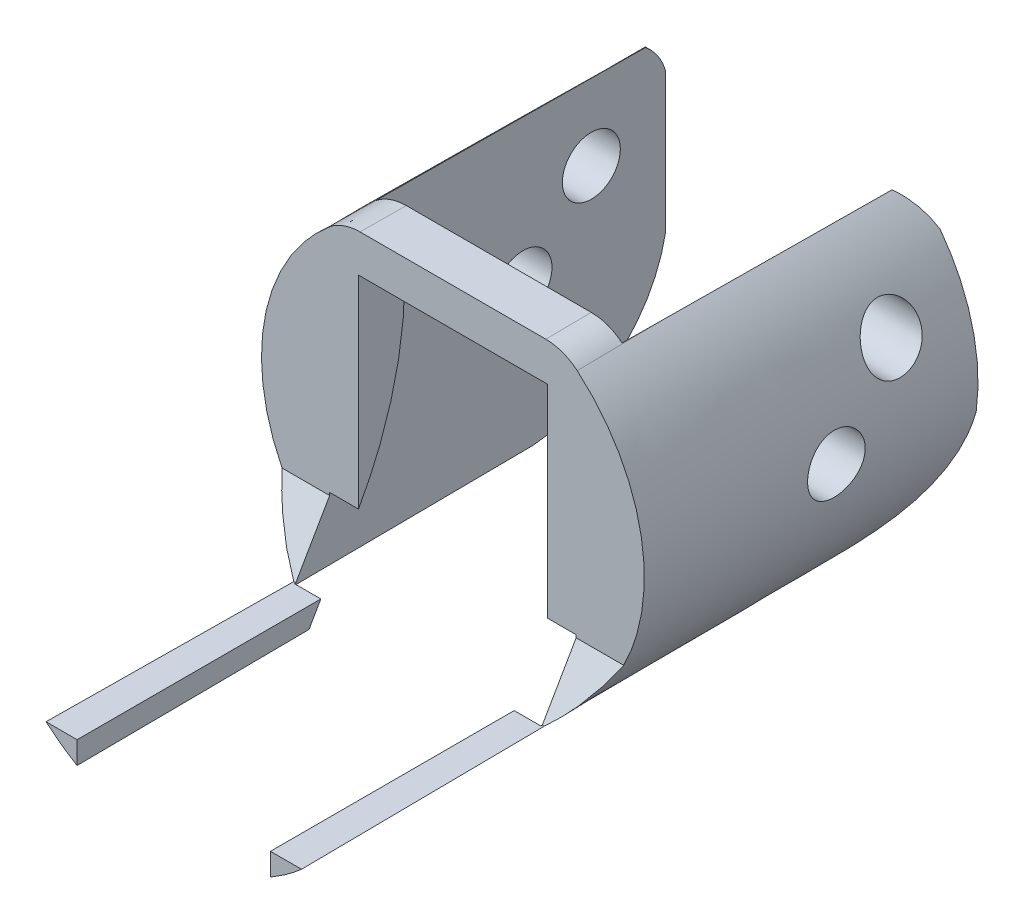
ISO-10303-21;
HEADER;
FILE_DESCRIPTION(('STEP AP214'),'2;1');
FILE_NAME('part.step','',(''),(''),'','','');
FILE_SCHEMA(('AUTOMOTIVE_DESIGN { 1 0 10303 214 1 1 1 1 }'));
ENDSEC;
DATA;
#1=APPLICATION_CONTEXT('core data for automotive mechanical design processes');
#2=APPLICATION_PROTOCOL_DEFINITION('international standard','automotive_design',2000,#1);
#3=PRODUCT_CONTEXT('',#1,'mechanical');
#4=PRODUCT('Part','Part','',(#3));
#5=PRODUCT_RELATED_PRODUCT_CATEGORY('part','',(#4));
#6=PRODUCT_DEFINITION_FORMATION('','',#4);
#7=PRODUCT_DEFINITION_CONTEXT('part definition',#1,'design');
#8=PRODUCT_DEFINITION('design','',#6,#7);
#9=PRODUCT_DEFINITION_SHAPE('','',#8);
#10=(LENGTH_UNIT() NAMED_UNIT(*) SI_UNIT(.MILLI.,.METRE.));
#11=(NAMED_UNIT(*) PLANE_ANGLE_UNIT() SI_UNIT($,.RADIAN.));
#12=(NAMED_UNIT(*) SI_UNIT($,.STERADIAN.) SOLID_ANGLE_UNIT());
#13=UNCERTAINTY_MEASURE_WITH_UNIT(LENGTH_MEASURE(1.E-05),#10,'distance_accuracy_value','');
#14=(GEOMETRIC_REPRESENTATION_CONTEXT(3) GLOBAL_UNCERTAINTY_ASSIGNED_CONTEXT((#13)) GLOBAL_UNIT_ASSIGNED_CONTEXT((#10,
#11,#12)) REPRESENTATION_CONTEXT('',''));
#15=CARTESIAN_POINT('',(0.,0.,0.));
#16=DIRECTION('',(0.,0.,1.));
#17=DIRECTION('',(1.,0.,0.));
#18=AXIS2_PLACEMENT_3D('',#15,#16,#17);
#19=CARTESIAN_POINT('',(-3.74165738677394,6.5,-56.3271202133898));
#20=CARTESIAN_POINT('',(-3.48711915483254,7.2,20.));
#21=CARTESIAN_POINT('',(-9.38126392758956,3.25361915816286,-56.3271202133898));
#22=CARTESIAN_POINT('',(-10.4110105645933,3.84660633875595,20.));
#23=CARTESIAN_POINT('',(-9.38126392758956,-3.25361915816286,-56.3271202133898));
#24=CARTESIAN_POINT('',(-10.4110105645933,-3.84660633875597,20.));
#25=CARTESIAN_POINT('',(-3.74165738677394,-6.5,-56.3271202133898));
#26=CARTESIAN_POINT('',(-3.48711915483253,-7.2,20.));
#27=(BOUNDED_SURFACE() B_SPLINE_SURFACE(3,1,((#19,#20),(#21,#22),(#23,#24),(#25,#26)),
.UNSPECIFIED.,.F.,.F.,.F.) B_SPLINE_SURFACE_WITH_KNOTS((4,4),(2,2),(0.,1.),(0.,1.),
.UNSPECIFIED.) GEOMETRIC_REPRESENTATION_ITEM() RATIONAL_B_SPLINE_SURFACE(((1.,1.),
(0.665925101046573,0.623926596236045),(0.665925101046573,0.623926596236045),(1.,1.))) REPRESENTATION_ITEM('') SURFACE());
#28=CARTESIAN_POINT('',(-5.28692939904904,-6.,19.55));
#29=CARTESIAN_POINT('',(-5.23396958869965,-6.04666447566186,19.55));
#30=CARTESIAN_POINT('',(-5.18039166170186,-6.09262741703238,19.55));
#31=CARTESIAN_POINT('',(-5.07215090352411,-6.18302434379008,19.55));
#32=CARTESIAN_POINT('',(-5.01749057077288,-6.22746132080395,19.55));
#33=CARTESIAN_POINT('',(-4.90709174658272,-6.31481470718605,19.55));
#34=CARTESIAN_POINT('',(-4.85135486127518,-6.35773314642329,19.55));
#35=CARTESIAN_POINT('',(-4.73880741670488,-6.44205508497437,19.55));
#36=CARTESIAN_POINT('',(-4.68199763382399,-6.48345962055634,19.55));
#37=CARTESIAN_POINT('',(-4.56730614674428,-6.56475645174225,19.55));
#38=CARTESIAN_POINT('',(-4.50942444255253,-6.60464874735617,19.55));
#39=CARTESIAN_POINT('',(-4.39258858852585,-6.68292070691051,19.55));
#40=CARTESIAN_POINT('',(-4.33363371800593,-6.72129929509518,19.55));
#41=CARTESIAN_POINT('',(-4.21464903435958,-6.79653997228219,19.55));
#42=CARTESIAN_POINT('',(-4.15461783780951,-6.83339987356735,19.55));
#43=CARTESIAN_POINT('',(-4.03347604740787,-6.90559635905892,19.55));
#44=CARTESIAN_POINT('',(-3.97236345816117,-6.94092959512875,19.55));
#45=CARTESIAN_POINT('',(-3.91079362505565,-6.97544727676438,19.55));
#46=B_SPLINE_CURVE_WITH_KNOTS('',3,(#28,#29,#30,#31,#32,#33,#34,#35,#36,#37,#38,#39,#40,#41,#42,
#43,#44,#45),.UNSPECIFIED.,.F.,.F.,(4,2,2,2,2,2,2,2,4),(0.,0.211750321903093,0.423058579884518,
0.634072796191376,0.844939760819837,1.0558067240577,1.26682094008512,1.47812919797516,
1.68987951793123),.UNSPECIFIED.);
#47=CARTESIAN_POINT('',(-5.28692939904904,-6.,19.55));
#48=VERTEX_POINT('',#47);
#49=CARTESIAN_POINT('',(-4.,-6.92468029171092,19.55));
#50=VERTEX_POINT('',#49);
#51=EDGE_CURVE('E67',#48,#50,#46,.T.);
#52=CARTESIAN_POINT('',(-5.16912422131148,-6.,8.));
#53=CARTESIAN_POINT('',(-5.18959387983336,-6.,9.99999925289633));
#54=CARTESIAN_POINT('',(-5.21002690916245,-6.,11.9999988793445));
#55=CARTESIAN_POINT('',(-5.25081970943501,-6.,15.9999988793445));
#56=CARTESIAN_POINT('',(-5.27117948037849,-6.,17.9999992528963));
#57=CARTESIAN_POINT('',(-5.29150262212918,-6.,20.));
#58=B_SPLINE_CURVE_WITH_KNOTS('',3,(#52,#53,#54,#55,#56,#57),.UNSPECIFIED.,.F.,.F.,(4,2,4),(0.,
6.00031200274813,12.0006240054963),.UNSPECIFIED.);
#59=CARTESIAN_POINT('',(-5.18344675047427,-6.,9.4));
#60=VERTEX_POINT('',#59);
#61=EDGE_CURVE('E238',#60,#48,#58,.T.);
#62=CARTESIAN_POINT('',(-5.18344675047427,-6.,9.4));
#63=CARTESIAN_POINT('',(-5.26408119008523,-5.93003464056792,9.35960548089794));
#64=CARTESIAN_POINT('',(-5.34305939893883,-5.85864217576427,9.31838702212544));
#65=CARTESIAN_POINT('',(-5.49719290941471,-5.71358698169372,9.23463936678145));
#66=CARTESIAN_POINT('',(-5.57236767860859,-5.6399397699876,9.19211912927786));
#67=CARTESIAN_POINT('',(-5.7190096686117,-5.49046009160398,9.1058169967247));
#68=CARTESIAN_POINT('',(-5.79049111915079,-5.41463808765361,9.06204114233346));
#69=CARTESIAN_POINT('',(-5.92984429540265,-5.26087798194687,8.97326770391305));
#70=CARTESIAN_POINT('',(-5.99772526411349,-5.18294616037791,8.92827374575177));
#71=CARTESIAN_POINT('',(-6.12995642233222,-5.02502239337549,8.83709641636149));
#72=CARTESIAN_POINT('',(-6.19431107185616,-4.94503324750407,8.79091466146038));
#73=CARTESIAN_POINT('',(-6.31952695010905,-4.78307113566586,8.69740579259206));
#74=CARTESIAN_POINT('',(-6.38038939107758,-4.70109887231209,8.65007908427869));
#75=CARTESIAN_POINT('',(-6.49870528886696,-4.53515867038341,8.55427346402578));
#76=CARTESIAN_POINT('',(-6.5561534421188,-4.4511878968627,8.50579291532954));
#77=CARTESIAN_POINT('',(-6.66767480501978,-4.2812663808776,8.40768868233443));
#78=CARTESIAN_POINT('',(-6.72173794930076,-4.19531068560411,8.3580621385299));
#79=CARTESIAN_POINT('',(-6.82650651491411,-4.02142712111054,8.25767041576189));
#80=CARTESIAN_POINT('',(-6.87719715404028,-3.93349257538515,8.20690138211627));
#81=CARTESIAN_POINT('',(-6.97522291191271,-3.75565020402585,8.10422404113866));
#82=CARTESIAN_POINT('',(-7.02253851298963,-3.66573430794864,8.05231107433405));
#83=CARTESIAN_POINT('',(-7.06801754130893,-3.57512886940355,8.00000000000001));
#84=B_SPLINE_CURVE_WITH_KNOTS('',3,(#62,#63,#64,#65,#66,#67,#68,#69,#70,#71,#72,#73,#74,#75,#76,
#77,#78,#79,#80,#81,#82,#83),.UNSPECIFIED.,.F.,.F.,(4,2,2,2,2,2,2,2,2,2,4),(0.,
0.342401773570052,0.682823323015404,1.02181686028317,1.35989323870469,1.69753165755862,
2.03505215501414,2.3730839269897,2.71207727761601,3.0524700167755,3.39469387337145),.UNSPECIFIED.);
#85=CARTESIAN_POINT('',(-7.06801754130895,-3.57512886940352,8.00000000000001));
#86=VERTEX_POINT('',#85);
#87=EDGE_CURVE('E792',#60,#86,#84,.T.);
#88=CARTESIAN_POINT('',(-5.16912422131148,-6.,8.));
#89=CARTESIAN_POINT('',(-5.3379168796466,-5.85473143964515,8.));
#90=CARTESIAN_POINT('',(-5.50054878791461,-5.70231106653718,8.));
#91=CARTESIAN_POINT('',(-5.81240096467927,-5.38433080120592,8.));
#92=CARTESIAN_POINT('',(-5.96162185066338,-5.21877151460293,8.));
#93=CARTESIAN_POINT('',(-6.2454799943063,-4.87578186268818,8.));
#94=CARTESIAN_POINT('',(-6.38012720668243,-4.69835973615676,8.));
#95=CARTESIAN_POINT('',(-6.63400151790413,-4.33280986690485,8.));
#96=CARTESIAN_POINT('',(-6.75322881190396,-4.14468225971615,8.));
#97=CARTESIAN_POINT('',(-6.97546691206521,-3.75896434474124,8.));
#98=CARTESIAN_POINT('',(-7.07847017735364,-3.56136969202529,8.));
#99=CARTESIAN_POINT('',(-7.26746159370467,-3.15820041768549,8.));
#100=CARTESIAN_POINT('',(-7.35344947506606,-2.95262566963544,8.));
#101=CARTESIAN_POINT('',(-7.50778027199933,-2.53500135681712,8.));
#102=CARTESIAN_POINT('',(-7.57612658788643,-2.32295304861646,8.));
#103=CARTESIAN_POINT('',(-7.69470868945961,-1.89385263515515,8.));
#104=CARTESIAN_POINT('',(-7.74494456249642,-1.67680055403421,8.));
#105=CARTESIAN_POINT('',(-7.82693451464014,-1.2393083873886,8.));
#106=CARTESIAN_POINT('',(-7.85869475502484,-1.0188694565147,8.));
#107=CARTESIAN_POINT('',(-7.90354055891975,-0.576027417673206,8.));
#108=CARTESIAN_POINT('',(-7.91662003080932,-0.353623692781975,8.));
#109=CARTESIAN_POINT('',(-7.92399117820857,0.0914723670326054,8.));
#110=CARTESIAN_POINT('',(-7.91828475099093,0.314164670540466,8.));
#111=CARTESIAN_POINT('',(-7.88812894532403,0.758276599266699,8.));
#112=CARTESIAN_POINT('',(-7.86367956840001,0.979696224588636,8.));
#113=CARTESIAN_POINT('',(-7.79621907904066,1.41964264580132,8.));
#114=CARTESIAN_POINT('',(-7.75321180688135,1.63817003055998,8.));
#115=CARTESIAN_POINT('',(-7.64895956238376,2.07075493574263,8.));
#116=CARTESIAN_POINT('',(-7.58772053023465,2.28481388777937,8.));
#117=CARTESIAN_POINT('',(-7.44739382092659,2.70714051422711,8.));
#118=CARTESIAN_POINT('',(-7.3682955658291,2.91540467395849,8.));
#119=CARTESIAN_POINT('',(-7.19283761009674,3.32452097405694,8.));
#120=CARTESIAN_POINT('',(-7.09647856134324,3.5253733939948,8.));
#121=CARTESIAN_POINT('',(-6.88708287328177,3.91843630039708,8.));
#122=CARTESIAN_POINT('',(-6.77403023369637,4.11063826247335,8.));
#123=CARTESIAN_POINT('',(-6.53212335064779,4.48482270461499,8.));
#124=CARTESIAN_POINT('',(-6.40326953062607,4.66680545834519,8.));
#125=CARTESIAN_POINT('',(-6.13092844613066,5.01894123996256,8.));
#126=CARTESIAN_POINT('',(-5.98746749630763,5.18911464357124,8.));
#127=CARTESIAN_POINT('',(-5.68679577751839,5.51671180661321,8.));
#128=CARTESIAN_POINT('',(-5.52959338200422,5.67414321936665,8.00000000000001));
#129=CARTESIAN_POINT('',(-5.31159773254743,5.8748175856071,8.));
#130=CARTESIAN_POINT('',(-5.25639037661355,5.92422433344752,8.));
#131=CARTESIAN_POINT('',(-5.14467308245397,6.02141581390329,8.));
#132=CARTESIAN_POINT('',(-5.08816465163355,6.06920227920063,8.));
#133=CARTESIAN_POINT('',(-5.03099192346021,6.1161931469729,8.));
#134=B_SPLINE_CURVE_WITH_KNOTS('',3,(#88,#89,#90,#91,#92,#93,#94,#95,#96,#97,#98,#99,#100,#101,
#102,#103,#104,#105,#106,#107,#108,#109,#110,#111,#112,#113,#114,#115,#116,#117,#118,#119,#120,
#121,#122,#123,#124,#125,#126,#127,#128,#129,#130,#131,#132,#133),.UNSPECIFIED.,.F.,.F.,(4,2,2,
2,2,2,2,2,2,2,2,2,2,2,2,2,2,2,2,2,2,2,4),(0.,0.667887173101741,1.33574357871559,
2.00314087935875,2.67052973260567,3.33822787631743,4.00593660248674,4.67351653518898,
5.34109324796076,6.00844720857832,6.67601873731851,7.34352284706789,8.01102690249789,
8.67839289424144,9.34554168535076,10.0130866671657,10.6806064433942,11.3487702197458,
12.0169160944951,12.6838789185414,13.350438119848,13.5726779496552,13.7946721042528),.UNSPECIFIED.);
#135=CARTESIAN_POINT('',(-5.14458977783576,6.02103275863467,8.));
#136=VERTEX_POINT('',#135);
#137=EDGE_CURVE('E1145',#86,#136,#134,.T.);
#138=CARTESIAN_POINT('',(-3.85814975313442,6.49999999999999,9.19335513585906));
#139=CARTESIAN_POINT('',(-4.59757549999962,6.49999999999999,9.18575937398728));
#140=CARTESIAN_POINT('',(-5.15915164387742,6.01895209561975,9.17999057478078));
#141=CARTESIAN_POINT('',(-3.8530468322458,6.49999999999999,8.69660034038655));
#142=CARTESIAN_POINT('',(-4.59170836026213,6.49999999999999,8.68907041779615));
#143=CARTESIAN_POINT('',(-5.1530265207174,6.01982765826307,8.68323957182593));
#144=CARTESIAN_POINT('',(-3.84794006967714,6.49999999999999,8.19984558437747));
#145=CARTESIAN_POINT('',(-4.58583564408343,6.49999999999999,8.19231975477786));
#146=CARTESIAN_POINT('',(-5.14689494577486,6.02070366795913,8.1864886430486));
#147=CARTESIAN_POINT('',(-3.83771884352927,6.49999999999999,7.20633615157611));
#148=CARTESIAN_POINT('',(-4.57408049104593,6.49999999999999,7.19881846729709));
#149=CARTESIAN_POINT('',(-5.13461885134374,6.02245656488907,7.19298693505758));
#150=CARTESIAN_POINT('',(-3.83260437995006,6.49999999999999,6.70958147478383));
#151=CARTESIAN_POINT('',(-4.56819805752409,6.49999999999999,6.7020679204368));
#152=CARTESIAN_POINT('',(-5.12847433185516,6.02333345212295,6.69623615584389));
#153=CARTESIAN_POINT('',(-3.8223677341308,6.49999999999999,5.71607220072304));
#154=CARTESIAN_POINT('',(-4.55642344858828,6.49999999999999,5.70856686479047));
#155=CARTESIAN_POINT('',(-5.11617230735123,6.02508808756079,5.7027347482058));
#156=CARTESIAN_POINT('',(-3.81724555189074,6.49999999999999,5.21931760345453));
#157=CARTESIAN_POINT('',(-4.55053127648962,6.49999999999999,5.21181643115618));
#158=CARTESIAN_POINT('',(-5.11001480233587,6.02596583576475,5.20598411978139));
#159=CARTESIAN_POINT('',(-3.80699345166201,6.49999999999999,4.2258084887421));
#160=CARTESIAN_POINT('',(-4.53873716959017,6.49999999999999,4.21831560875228));
#161=CARTESIAN_POINT('',(-5.09768676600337,6.02772217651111,4.21248301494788));
#162=CARTESIAN_POINT('',(-3.80186353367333,6.49999999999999,3.72905397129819));
#163=CARTESIAN_POINT('',(-4.53283523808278,6.49999999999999,3.72156529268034));
#164=CARTESIAN_POINT('',(-5.09151623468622,6.0286007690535,3.71573253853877));
#165=CARTESIAN_POINT('',(-3.79672973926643,6.49999999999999,3.2322994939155));
#166=CARTESIAN_POINT('',(-4.52692767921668,6.49999999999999,3.2247531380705));
#167=CARTESIAN_POINT('',(-5.08533916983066,6.02947977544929,3.21898213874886));
#168=(BOUNDED_SURFACE() B_SPLINE_SURFACE(3,2,((#138,#139,#140),(#141,#142,#143),(#144,#145,
#146),(#147,#148,#149),(#150,#151,#152),(#153,#154,#155),(#156,#157,#158),(#159,#160,#161),
(#162,#163,#164),(#165,#166,#167)),.UNSPECIFIED.,.F.,.F.,.F.) B_SPLINE_SURFACE_WITH_KNOTS((4,2,
2,2,4),(3,3),(0.,1.49034301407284,2.98068602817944,4.47102904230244,5.96137205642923),(0.,1.),
.UNSPECIFIED.) GEOMETRIC_REPRESENTATION_ITEM() RATIONAL_B_SPLINE_SURFACE(((1.,0.937943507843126,
1.),(1.,0.938060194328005,1.),(1.,0.938176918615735,1.),(1.,0.938410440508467,1.),(1.,
0.938527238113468,1.),(1.,0.938760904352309,1.),(1.,0.938877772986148,1.),(1.,0.939111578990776,
1.),(1.,0.939228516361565,1.),(1.,0.939345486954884,1.))) REPRESENTATION_ITEM('') SURFACE());
#169=CARTESIAN_POINT('',(-5.15915164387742,6.01895209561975,9.17999057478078));
#170=CARTESIAN_POINT('',(-5.1530265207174,6.01982765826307,8.68323957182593));
#171=CARTESIAN_POINT('',(-5.14689494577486,6.02070366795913,8.1864886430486));
#172=CARTESIAN_POINT('',(-5.13461885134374,6.02245656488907,7.19298693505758));
#173=CARTESIAN_POINT('',(-5.12847433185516,6.02333345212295,6.69623615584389));
#174=CARTESIAN_POINT('',(-5.11617230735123,6.02508808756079,5.7027347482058));
#175=CARTESIAN_POINT('',(-5.11001480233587,6.02596583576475,5.20598411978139));
#176=CARTESIAN_POINT('',(-5.09768676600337,6.02772217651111,4.21248301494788));
#177=CARTESIAN_POINT('',(-5.09151623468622,6.0286007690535,3.71573253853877));
#178=CARTESIAN_POINT('',(-5.08533916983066,6.02947977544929,3.21898213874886));
#179=B_SPLINE_CURVE_WITH_KNOTS('',3,(#169,#170,#171,#172,#173,#174,#175,#176,#177,#178),
.UNSPECIFIED.,.F.,.F.,(4,2,2,2,4),(0.,1.49034301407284,2.98068602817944,4.47102904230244,
5.96137205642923),.UNSPECIFIED.);
#180=CARTESIAN_POINT('',(-5.09999999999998,6.02739255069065,4.39897194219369));
#181=VERTEX_POINT('',#180);
#182=EDGE_CURVE('E685',#136,#181,#179,.T.);
#183=CARTESIAN_POINT('',(-5.09999999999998,6.04223560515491,6.1));
#184=CARTESIAN_POINT('',(-5.09999999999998,6.00734728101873,2.1));
#185=CARTESIAN_POINT('',(-5.09999999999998,5.97245895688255,-1.90000000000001));
#186=CARTESIAN_POINT('',(-5.09999999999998,5.93757063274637,-5.90000000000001));
#187=B_SPLINE_CURVE_WITH_KNOTS('',3,(#183,#184,#185,#186),.UNSPECIFIED.,.F.,.F.,(4,4),(0.,
12.0004564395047),.UNSPECIFIED.);
#188=CARTESIAN_POINT('',(-5.09999999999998,5.94479848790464,-5.07091019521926));
#189=VERTEX_POINT('',#188);
#190=EDGE_CURVE('E686',#181,#189,#187,.T.);
#191=CARTESIAN_POINT('',(-5.03649253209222,5.99922665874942,-5.00103056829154));
#192=CARTESIAN_POINT('',(-5.06704175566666,5.97331853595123,-5.03553276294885));
#193=CARTESIAN_POINT('',(-5.09797485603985,5.94669315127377,-5.0691400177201));
#194=CARTESIAN_POINT('',(-5.16045011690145,5.8920593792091,-5.13460451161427));
#195=CARTESIAN_POINT('',(-5.19199216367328,5.8640512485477,-5.16646207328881));
#196=CARTESIAN_POINT('',(-5.28727727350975,5.77804562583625,-5.25945573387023));
#197=CARTESIAN_POINT('',(-5.35171202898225,5.71803932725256,-5.31804930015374));
#198=CARTESIAN_POINT('',(-5.48192391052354,5.59248948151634,-5.42900280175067));
#199=CARTESIAN_POINT('',(-5.54770769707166,5.52690479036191,-5.4813080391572));
#200=CARTESIAN_POINT('',(-5.67931281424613,5.39083494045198,-5.57908539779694));
#201=CARTESIAN_POINT('',(-5.74513414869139,5.3203491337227,-5.62455661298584));
#202=CARTESIAN_POINT('',(-5.87808098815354,5.17250424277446,-5.7096893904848));
#203=CARTESIAN_POINT('',(-5.94518612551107,5.09500214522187,-5.74913492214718));
#204=CARTESIAN_POINT('',(-6.07798899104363,4.93530559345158,-5.82009373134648));
#205=CARTESIAN_POINT('',(-6.14368689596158,4.85311173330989,-5.85160801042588));
#206=CARTESIAN_POINT('',(-6.27272308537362,4.68476933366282,-5.9060092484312));
#207=CARTESIAN_POINT('',(-6.33607078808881,4.59864060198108,-5.92893500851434));
#208=CARTESIAN_POINT('',(-6.46003953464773,4.42262061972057,-5.96565644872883));
#209=CARTESIAN_POINT('',(-6.52066286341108,4.33273264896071,-5.97945991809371));
#210=CARTESIAN_POINT('',(-6.60519294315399,4.20163211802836,-5.99217484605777));
#211=CARTESIAN_POINT('',(-6.63046566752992,4.16165638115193,-5.99509328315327));
#212=CARTESIAN_POINT('',(-6.68033142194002,4.08119559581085,-5.99900552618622));
#213=CARTESIAN_POINT('',(-6.70492451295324,4.04071059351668,-5.99999950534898));
#214=CARTESIAN_POINT('',(-6.72915752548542,3.99999999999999,-6.00000000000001));
#215=B_SPLINE_CURVE_WITH_KNOTS('',3,(#191,#192,#193,#194,#195,#196,#197,#198,#199,#200,#201,
#202,#203,#204,#205,#206,#207,#208,#209,#210,#211,#212,#213,#214),.UNSPECIFIED.,.F.,.F.,(4,2,2,
2,2,2,2,2,2,2,2,4),(0.,0.158567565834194,0.317105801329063,0.634014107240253,0.953505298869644,
1.2730388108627,1.60218888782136,1.93129737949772,2.25890056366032,2.58622365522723,
2.72833767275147,2.87043889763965),.UNSPECIFIED.);
#216=CARTESIAN_POINT('',(-6.2604577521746,4.69999999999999,-5.9));
#217=VERTEX_POINT('',#216);
#218=EDGE_CURVE('E616',#189,#217,#215,.T.);
#219=CARTESIAN_POINT('',(-5.09999999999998,5.93757063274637,-5.9));
#220=CARTESIAN_POINT('',(-5.26706693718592,5.79430526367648,-5.9));
#221=CARTESIAN_POINT('',(-5.42805920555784,5.64396229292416,-5.9));
#222=CARTESIAN_POINT('',(-5.73681428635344,5.33026832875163,-5.9));
#223=CARTESIAN_POINT('',(-5.88457769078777,5.16691791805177,-5.9));
#224=CARTESIAN_POINT('',(-6.16569852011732,4.82847752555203,-5.9));
#225=CARTESIAN_POINT('',(-6.29906728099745,4.65339696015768,-5.9));
#226=CARTESIAN_POINT('',(-6.55058710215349,4.29263000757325,-5.9));
#227=CARTESIAN_POINT('',(-6.66873836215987,4.10694375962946,-5.9));
#228=CARTESIAN_POINT('',(-6.88901596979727,3.72622087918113,-5.9));
#229=CARTESIAN_POINT('',(-6.99113735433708,3.53118137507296,-5.9));
#230=CARTESIAN_POINT('',(-7.17861822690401,3.13311665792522,-5.9));
#231=CARTESIAN_POINT('',(-7.26397142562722,2.9300884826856,-5.9));
#232=CARTESIAN_POINT('',(-7.41721832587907,2.51766748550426,-5.9));
#233=CARTESIAN_POINT('',(-7.485121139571,2.30827804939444,-5.9));
#234=CARTESIAN_POINT('',(-7.60306774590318,1.88442585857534,-5.9));
#235=CARTESIAN_POINT('',(-7.6531034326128,1.66996084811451,-5.9));
#236=CARTESIAN_POINT('',(-7.73490087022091,1.23765155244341,-5.9));
#237=CARTESIAN_POINT('',(-7.76666900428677,1.01980847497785,-5.9));
#238=CARTESIAN_POINT('',(-7.81172130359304,0.582319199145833,-5.9));
#239=CARTESIAN_POINT('',(-7.82501384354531,0.362673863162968,-5.9));
#240=CARTESIAN_POINT('',(-7.83304844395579,-0.0770331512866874,-5.9));
#241=CARTESIAN_POINT('',(-7.82778398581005,-0.297094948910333,-5.9));
#242=CARTESIAN_POINT('',(-7.79873288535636,-0.735914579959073,-5.9));
#243=CARTESIAN_POINT('',(-7.77495276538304,-0.954672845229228,-5.9));
#244=CARTESIAN_POINT('',(-7.70905429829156,-1.38936644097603,-5.9));
#245=CARTESIAN_POINT('',(-7.66693949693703,-1.60530230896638,-5.9));
#246=CARTESIAN_POINT('',(-7.56467378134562,-2.03285679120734,-5.9));
#247=CARTESIAN_POINT('',(-7.50452308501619,-2.24447545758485,-5.9));
#248=CARTESIAN_POINT('',(-7.36659265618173,-2.66195859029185,-5.9));
#249=CARTESIAN_POINT('',(-7.28880772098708,-2.86782133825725,-5.9));
#250=CARTESIAN_POINT('',(-7.11617615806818,-3.27226343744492,-5.9));
#251=CARTESIAN_POINT('',(-7.02132908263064,-3.47084259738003,-5.90000000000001));
#252=CARTESIAN_POINT('',(-6.80407726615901,-3.88035487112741,-5.90000000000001));
#253=CARTESIAN_POINT('',(-6.67980078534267,-4.09029813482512,-5.9));
#254=CARTESIAN_POINT('',(-6.41218925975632,-4.4976943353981,-5.9));
#255=CARTESIAN_POINT('',(-6.26885172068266,-4.69514563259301,-5.9));
#256=CARTESIAN_POINT('',(-5.96408070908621,-5.07617378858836,-5.9));
#257=CARTESIAN_POINT('',(-5.80261310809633,-5.25972335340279,-5.9));
#258=CARTESIAN_POINT('',(-5.46325916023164,-5.61094618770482,-5.9));
#259=CARTESIAN_POINT('',(-5.28537335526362,-5.77861998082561,-5.9));
#260=CARTESIAN_POINT('',(-5.09999999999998,-5.93757063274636,-5.9));
#261=B_SPLINE_CURVE_WITH_KNOTS('',3,(#219,#220,#221,#222,#223,#224,#225,#226,#227,#228,#229,
#230,#231,#232,#233,#234,#235,#236,#237,#238,#239,#240,#241,#242,#243,#244,#245,#246,#247,#248,
#249,#250,#251,#252,#253,#254,#255,#256,#257,#258,#259,#260),.UNSPECIFIED.,.F.,.F.,(4,2,2,2,2,2,
2,2,2,2,2,2,2,2,2,2,2,2,2,2,4),(0.,0.660046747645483,1.32006394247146,1.97955751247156,
2.63904242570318,3.2987311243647,3.95866678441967,4.61825713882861,5.2781463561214,
5.93780485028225,6.59716423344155,7.25675525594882,7.91611403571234,8.57534535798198,
9.2345687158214,9.89398682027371,10.5534222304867,11.2842458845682,12.0151652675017,
12.7474843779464,13.4797793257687),.UNSPECIFIED.);
#262=CARTESIAN_POINT('',(-7.75387023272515,-1.09087121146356,-5.9));
#263=VERTEX_POINT('',#262);
#264=EDGE_CURVE('E693',#217,#263,#261,.T.);
#265=CARTESIAN_POINT('',(-7.82967994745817,-0.00284338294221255,-5.99999932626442));
#266=CARTESIAN_POINT('',(-7.82965454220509,-0.0762801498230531,-5.99996531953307));
#267=CARTESIAN_POINT('',(-7.82860089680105,-0.149705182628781,-5.99858114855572));
#268=CARTESIAN_POINT('',(-7.82445007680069,-0.296394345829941,-5.99312411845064));
#269=CARTESIAN_POINT('',(-7.82135298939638,-0.36965848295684,-5.98905137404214));
#270=CARTESIAN_POINT('',(-7.8090232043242,-0.588882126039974,-5.97282723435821));
#271=CARTESIAN_POINT('',(-7.79675188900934,-0.734404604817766,-5.95666982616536));
#272=CARTESIAN_POINT('',(-7.76450820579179,-1.02201267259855,-5.91409254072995));
#273=CARTESIAN_POINT('',(-7.74458908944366,-1.16411496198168,-5.88774361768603));
#274=CARTESIAN_POINT('',(-7.69749595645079,-1.44491839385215,-5.82519559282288));
#275=CARTESIAN_POINT('',(-7.67032112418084,-1.58361915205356,-5.78899538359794));
#276=CARTESIAN_POINT('',(-7.60937215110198,-1.85637005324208,-5.70737249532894));
#277=CARTESIAN_POINT('',(-7.57561538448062,-1.9904313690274,-5.66197408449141));
#278=CARTESIAN_POINT('',(-7.50211511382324,-2.25361387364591,-5.56246710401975));
#279=CARTESIAN_POINT('',(-7.46236922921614,-2.38273307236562,-5.50835507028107));
#280=CARTESIAN_POINT('',(-7.33513423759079,-2.76201511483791,-5.33373406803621));
#281=CARTESIAN_POINT('',(-7.23967546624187,-3.00398285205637,-5.20097665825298));
#282=CARTESIAN_POINT('',(-7.02400539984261,-3.48425218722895,-4.89374829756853));
#283=CARTESIAN_POINT('',(-6.90231839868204,-3.72012460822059,-4.71654780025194));
#284=CARTESIAN_POINT('',(-6.71218239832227,-4.05042404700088,-4.42893105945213));
#285=CARTESIAN_POINT('',(-6.64746709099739,-4.1567008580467,-4.32931139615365));
#286=CARTESIAN_POINT('',(-6.51652486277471,-4.36128536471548,-4.12313858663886));
#287=CARTESIAN_POINT('',(-6.45029824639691,-4.4595946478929,-4.01658682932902));
#288=CARTESIAN_POINT('',(-6.30350043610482,-4.66786218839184,-3.77382091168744));
#289=CARTESIAN_POINT('',(-6.22282673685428,-4.77595494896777,-3.63606457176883));
#290=CARTESIAN_POINT('',(-6.06291212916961,-4.98009193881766,-3.35103419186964));
#291=CARTESIAN_POINT('',(-5.98367169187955,-5.07613226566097,-3.2037570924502));
#292=CARTESIAN_POINT('',(-5.82913747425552,-5.25563189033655,-2.8999016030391));
#293=CARTESIAN_POINT('',(-5.75384056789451,-5.33910125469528,-2.74333079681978));
#294=CARTESIAN_POINT('',(-5.61009945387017,-5.4927959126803,-2.4209700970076));
#295=CARTESIAN_POINT('',(-5.54165096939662,-5.56302949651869,-2.25518605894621));
#296=CARTESIAN_POINT('',(-5.39616379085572,-5.70813147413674,-1.86352599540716));
#297=CARTESIAN_POINT('',(-5.32262100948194,-5.77817026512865,-1.63443759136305));
#298=CARTESIAN_POINT('',(-5.2321490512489,-5.86281724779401,-1.28140092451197));
#299=CARTESIAN_POINT('',(-5.20532390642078,-5.88760933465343,-1.16233807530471));
#300=CARTESIAN_POINT('',(-5.15927707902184,-5.93006919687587,-0.921522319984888));
#301=CARTESIAN_POINT('',(-5.14005154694,-5.9477405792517,-0.799770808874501));
#302=CARTESIAN_POINT('',(-5.11143994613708,-5.9743584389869,-0.565395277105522));
#303=CARTESIAN_POINT('',(-5.10132481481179,-5.98394635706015,-0.452934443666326));
#304=CARTESIAN_POINT('',(-5.09173954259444,-5.99356447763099,-0.28354558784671));
#305=CARTESIAN_POINT('',(-5.08947639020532,-5.99597658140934,-0.226893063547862));
#306=CARTESIAN_POINT('',(-5.08684306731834,-5.99919484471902,-0.113492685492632));
#307=CARTESIAN_POINT('',(-5.08647309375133,-6.00000083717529,-0.0567448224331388));
#308=CARTESIAN_POINT('',(-5.08705900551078,-6.,0.));
#309=B_SPLINE_CURVE_WITH_KNOTS('',3,(#265,#266,#267,#268,#269,#270,#271,#272,#273,#274,#275,
#276,#277,#278,#279,#280,#281,#282,#283,#284,#285,#286,#287,#288,#289,#290,#291,#292,#293,#294,
#295,#296,#297,#298,#299,#300,#301,#302,#303,#304,#305,#306,#307,#308),.UNSPECIFIED.,.F.,.F.,(4,
2,2,2,2,2,2,2,2,2,2,2,2,2,2,2,2,2,2,2,2,4),(0.,0.220269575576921,0.440529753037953,
0.880656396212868,1.31777244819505,1.75493765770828,2.1909641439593,2.62716440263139,
3.49994471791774,4.45381192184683,4.93170960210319,5.4095118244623,5.98727013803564,
6.56521504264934,7.14269465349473,7.71981134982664,8.46850135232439,8.84174166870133,
9.2147926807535,9.55431366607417,9.72451246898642,9.89472897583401),.UNSPECIFIED.);
#310=CARTESIAN_POINT('',(-5.09999999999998,-5.98536440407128,-0.418823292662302));
#311=VERTEX_POINT('',#310);
#312=EDGE_CURVE('E589',#263,#311,#309,.T.);
#313=CARTESIAN_POINT('',(-5.09999999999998,-5.93757063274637,-5.9));
#314=CARTESIAN_POINT('',(-5.09999999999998,-5.97244065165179,-1.89999984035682));
#315=CARTESIAN_POINT('',(-5.09999999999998,-6.00732940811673,2.10000015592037));
#316=CARTESIAN_POINT('',(-5.09999999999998,-6.06812356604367,9.0665746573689));
#317=CARTESIAN_POINT('',(-5.09999999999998,-6.09402111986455,12.0331492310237));
#318=CARTESIAN_POINT('',(-5.09999999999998,-6.12757372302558,15.8752677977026));
#319=CARTESIAN_POINT('',(-5.09999999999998,-6.1352204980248,16.7508118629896));
#320=CARTESIAN_POINT('',(-5.09999999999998,-6.14286804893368,17.6263559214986));
#321=B_SPLINE_CURVE_WITH_KNOTS('',3,(#313,#314,#315,#316,#317,#318,#319,#320),.UNSPECIFIED.,.F.,
.F.,(4,2,2,4),(0.,12.0004564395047,20.9005192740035,23.5272516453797),.UNSPECIFIED.);
#322=CARTESIAN_POINT('',(-5.09999999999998,-6.07195934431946,9.50564736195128));
#323=VERTEX_POINT('',#322);
#324=EDGE_CURVE('E543',#311,#323,#321,.T.);
#325=CARTESIAN_POINT('',(-5.09999999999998,-6.0719593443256,9.50564736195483));
#326=CARTESIAN_POINT('',(-5.04046921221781,-6.12217804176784,9.53464114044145));
#327=CARTESIAN_POINT('',(-4.98006843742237,-6.17162454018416,9.5631890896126));
#328=CARTESIAN_POINT('',(-4.85773952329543,-6.26876709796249,9.61927437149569));
#329=CARTESIAN_POINT('',(-4.79581630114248,-6.31646780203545,9.64681438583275));
#330=CARTESIAN_POINT('',(-4.6704344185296,-6.41011124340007,9.70087945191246));
#331=CARTESIAN_POINT('',(-4.60697902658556,-6.45605726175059,9.72740639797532));
#332=CARTESIAN_POINT('',(-4.47852102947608,-6.54617920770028,9.77943832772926));
#333=CARTESIAN_POINT('',(-4.41352007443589,-6.59035689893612,9.80494432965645));
#334=CARTESIAN_POINT('',(-4.28194545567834,-6.67693106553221,9.85492794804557));
#335=CARTESIAN_POINT('',(-4.21537164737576,-6.7193273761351,9.8794054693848));
#336=CARTESIAN_POINT('',(-4.08064026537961,-6.80230926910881,9.92731508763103));
#337=CARTESIAN_POINT('',(-4.01248124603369,-6.84289309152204,9.95074616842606));
#338=CARTESIAN_POINT('',(-3.87455643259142,-6.92222042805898,9.99654582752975));
#339=CARTESIAN_POINT('',(-3.80478774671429,-6.96096017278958,10.0189122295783));
#340=CARTESIAN_POINT('',(-3.66361712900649,-7.03656427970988,10.0625622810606));
#341=CARTESIAN_POINT('',(-3.59221090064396,-7.07342262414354,10.0838424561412));
#342=CARTESIAN_POINT('',(-3.52011891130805,-7.10924809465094,10.1045263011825));
#343=B_SPLINE_CURVE_WITH_KNOTS('',3,(#325,#326,#327,#328,#329,#330,#331,#332,#333,#334,#335,
#336,#337,#338,#339,#340,#341,#342),.UNSPECIFIED.,.F.,.F.,(4,2,2,2,2,2,2,2,4),(0.,
0.249307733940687,0.497895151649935,0.745992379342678,0.993835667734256,1.24170182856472,
1.48980365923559,1.73839257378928,1.9877323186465),.UNSPECIFIED.);
#344=CARTESIAN_POINT('',(-4.,-6.84976127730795,9.9547115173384));
#345=VERTEX_POINT('',#344);
#346=EDGE_CURVE('E633',#323,#345,#343,.T.);
#347=CARTESIAN_POINT('',(-4.,-6.84544206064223,9.39999999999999));
#348=CARTESIAN_POINT('',(-4.,-6.85919633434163,11.1666669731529));
#349=CARTESIAN_POINT('',(-4.,-6.87297023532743,12.9333337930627));
#350=CARTESIAN_POINT('',(-4.,-6.90055729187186,16.4666671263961));
#351=CARTESIAN_POINT('',(-4.,-6.91437044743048,18.2333336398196));
#352=CARTESIAN_POINT('',(-4.,-6.92820323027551,20.));
#353=B_SPLINE_CURVE_WITH_KNOTS('',3,(#347,#348,#349,#350,#351,#352),.UNSPECIFIED.,.F.,.F.,(4,2,
4),(0.,5.30016154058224,10.6003230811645),.UNSPECIFIED.);
#354=EDGE_CURVE('E241',#345,#50,#353,.T.);
#355=CARTESIAN_POINT('',(-7.31407421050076,2.82842712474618,-4.02842712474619));
#356=CARTESIAN_POINT('',(-7.34044671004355,2.76031827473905,-4.0284252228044));
#357=CARTESIAN_POINT('',(-7.36590613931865,2.69182325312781,-4.02261715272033));
#358=CARTESIAN_POINT('',(-7.414371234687,2.55596653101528,-3.9991189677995));
#359=CARTESIAN_POINT('',(-7.43737585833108,2.48860532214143,-3.98142382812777));
#360=CARTESIAN_POINT('',(-7.48051114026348,2.35699060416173,-3.93416014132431));
#361=CARTESIAN_POINT('',(-7.50063509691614,2.29274456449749,-3.9045644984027));
#362=CARTESIAN_POINT('',(-7.53765263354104,2.16979102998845,-3.83402050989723));
#363=CARTESIAN_POINT('',(-7.554547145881,2.11108193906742,-3.79307544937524));
#364=CARTESIAN_POINT('',(-7.58430941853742,2.00391664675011,-3.70298833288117));
#365=CARTESIAN_POINT('',(-7.59732609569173,1.95511415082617,-3.654307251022));
#366=CARTESIAN_POINT('',(-7.62037191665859,1.86629962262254,-3.54888404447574));
#367=CARTESIAN_POINT('',(-7.63040160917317,1.82628597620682,-3.49214340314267));
#368=CARTESIAN_POINT('',(-7.64728364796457,1.7577692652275,-3.37446720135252));
#369=CARTESIAN_POINT('',(-7.65423800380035,1.72890148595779,-3.31375830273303));
#370=CARTESIAN_POINT('',(-7.66561431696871,1.68165421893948,-3.18816567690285));
#371=CARTESIAN_POINT('',(-7.67003652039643,1.66327371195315,-3.12328235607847));
#372=CARTESIAN_POINT('',(-7.676399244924,1.63781295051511,-2.99222213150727));
#373=CARTESIAN_POINT('',(-7.67837559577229,1.6305691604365,-2.92607867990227));
#374=CARTESIAN_POINT('',(-7.68000040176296,1.62710424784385,-2.7934755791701));
#375=CARTESIAN_POINT('',(-7.67964894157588,1.63088272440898,-2.72701594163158));
#376=CARTESIAN_POINT('',(-7.67658706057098,1.64930515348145,-2.59598647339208));
#377=CARTESIAN_POINT('',(-7.67388739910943,1.66389950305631,-2.53140940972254));
#378=CARTESIAN_POINT('',(-7.6660422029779,1.70343228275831,-2.40566231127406));
#379=CARTESIAN_POINT('',(-7.6608967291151,1.72837045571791,-2.34449219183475));
#380=CARTESIAN_POINT('',(-7.64801792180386,1.78780045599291,-2.22724692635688));
#381=CARTESIAN_POINT('',(-7.64028338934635,1.82229670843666,-2.17117415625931));
#382=CARTESIAN_POINT('',(-7.62209168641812,1.89971337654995,-2.06568781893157));
#383=CARTESIAN_POINT('',(-7.61163452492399,1.94263376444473,-2.01627422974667));
#384=CARTESIAN_POINT('',(-7.58781021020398,2.03590643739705,-1.9249861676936));
#385=CARTESIAN_POINT('',(-7.57441891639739,2.08631918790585,-1.88317984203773));
#386=CARTESIAN_POINT('',(-7.54478859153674,2.19267645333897,-1.80860299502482));
#387=CARTESIAN_POINT('',(-7.52854931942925,2.24862143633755,-1.7758332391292));
#388=CARTESIAN_POINT('',(-7.49289089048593,2.36585981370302,-1.71920200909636));
#389=CARTESIAN_POINT('',(-7.47339920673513,2.4272553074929,-1.69559807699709));
#390=CARTESIAN_POINT('',(-7.43184386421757,2.55225137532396,-1.65882261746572));
#391=CARTESIAN_POINT('',(-7.4097796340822,2.61585243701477,-1.64565341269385));
#392=CARTESIAN_POINT('',(-7.36230763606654,2.74686018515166,-1.62929158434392));
#393=CARTESIAN_POINT('',(-7.33678611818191,2.81429397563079,-1.62664850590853));
#394=CARTESIAN_POINT('',(-7.28399376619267,2.94797682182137,-1.63252199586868));
#395=CARTESIAN_POINT('',(-7.25672236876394,3.01422548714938,-1.64104217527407));
#396=CARTESIAN_POINT('',(-7.19934533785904,3.14828264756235,-1.66968055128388));
#397=CARTESIAN_POINT('',(-7.16917126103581,3.21590719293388,-1.6905246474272));
#398=CARTESIAN_POINT('',(-7.10871305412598,3.34644948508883,-1.74370382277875));
#399=CARTESIAN_POINT('',(-7.07842888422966,3.4093653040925,-1.77604357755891));
#400=CARTESIAN_POINT('',(-7.01779206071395,3.53126780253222,-1.85302384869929));
#401=CARTESIAN_POINT('',(-6.98748274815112,3.59000574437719,-1.89809469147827));
#402=CARTESIAN_POINT('',(-6.92961667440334,3.69892251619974,-1.99911913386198));
#403=CARTESIAN_POINT('',(-6.90205992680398,3.74910130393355,-2.05507278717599));
#404=CARTESIAN_POINT('',(-6.85269360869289,3.83684940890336,-2.17398640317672));
#405=CARTESIAN_POINT('',(-6.83067968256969,3.8748883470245,-2.23651208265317));
#406=CARTESIAN_POINT('',(-6.79262758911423,3.93939545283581,-2.36891561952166));
#407=CARTESIAN_POINT('',(-6.77658119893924,3.96587955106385,-2.4387831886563));
#408=CARTESIAN_POINT('',(-6.75368542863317,4.00293592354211,-2.57391920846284));
#409=CARTESIAN_POINT('',(-6.74590287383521,4.01514487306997,-2.63858081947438));
#410=CARTESIAN_POINT('',(-6.73675563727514,4.02877746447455,-2.76946434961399));
#411=CARTESIAN_POINT('',(-6.73538591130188,4.030209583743,-2.8356850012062));
#412=CARTESIAN_POINT('',(-6.7389643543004,4.02263132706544,-2.96008419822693));
#413=CARTESIAN_POINT('',(-6.74324246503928,4.01473826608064,-3.01835501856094));
#414=CARTESIAN_POINT('',(-6.75663620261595,3.99070723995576,-3.13258334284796));
#415=CARTESIAN_POINT('',(-6.76575204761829,3.97456890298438,-3.18854074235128));
#416=CARTESIAN_POINT('',(-6.78831561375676,3.93453086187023,-3.29740375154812));
#417=CARTESIAN_POINT('',(-6.80181172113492,3.91054443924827,-3.35026710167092));
#418=CARTESIAN_POINT('',(-6.83229169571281,3.85576358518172,-3.45122891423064));
#419=CARTESIAN_POINT('',(-6.84927665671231,3.82496701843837,-3.49932587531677));
#420=CARTESIAN_POINT('',(-6.88788013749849,3.7538288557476,-3.59494884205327));
#421=CARTESIAN_POINT('',(-6.90980097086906,3.71281560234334,-3.64185216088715));
#422=CARTESIAN_POINT('',(-6.95584841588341,3.62470101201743,-3.72829541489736));
#423=CARTESIAN_POINT('',(-6.9799766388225,3.57759521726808,-3.76782990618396));
#424=CARTESIAN_POINT('',(-7.03261517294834,3.47211361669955,-3.84351018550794));
#425=CARTESIAN_POINT('',(-7.06129481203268,3.41306555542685,-3.8786032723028));
#426=CARTESIAN_POINT('',(-7.119079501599,3.29006799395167,-3.93818144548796));
#427=CARTESIAN_POINT('',(-7.14818438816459,3.22612034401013,-3.9626705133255));
#428=CARTESIAN_POINT('',(-7.20053469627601,3.10684049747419,-3.99701603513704));
#429=CARTESIAN_POINT('',(-7.22387590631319,3.05207876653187,-4.00873226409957));
#430=CARTESIAN_POINT('',(-7.26971204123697,2.94110885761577,-4.02443843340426));
#431=CARTESIAN_POINT('',(-7.29220700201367,2.88490074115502,-4.02842870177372));
#432=CARTESIAN_POINT('',(-7.31407421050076,2.82842712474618,-4.02842712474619));
#433=B_SPLINE_CURVE_WITH_KNOTS('',3,(#355,#356,#357,#358,#359,#360,#361,#362,#363,#364,#365,
#366,#367,#368,#369,#370,#371,#372,#373,#374,#375,#376,#377,#378,#379,#380,#381,#382,#383,#384,
#385,#386,#387,#388,#389,#390,#391,#392,#393,#394,#395,#396,#397,#398,#399,#400,#401,#402,#403,
#404,#405,#406,#407,#408,#409,#410,#411,#412,#413,#414,#415,#416,#417,#418,#419,#420,#421,#422,
#423,#424,#425,#426,#427,#428,#429,#430,#431,#432),.UNSPECIFIED.,.T.,.F.,(4,2,2,2,2,2,2,2,2,2,2,
2,2,2,2,2,2,2,2,2,2,2,2,2,2,2,2,2,2,2,2,2,2,2,2,2,2,2,4),(0.,0.21890824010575,0.437909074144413,
0.65741139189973,0.876850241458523,1.0862449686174,1.29560120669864,1.4973673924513,
1.69911396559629,1.8978687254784,2.09661625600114,2.29445790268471,2.49229463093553,
2.69022310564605,2.88815092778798,3.08777281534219,3.28741160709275,3.49231193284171,
3.69725785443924,3.91277337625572,4.12835862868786,4.35812196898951,4.58797886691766,
4.82679514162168,5.06561259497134,5.2935706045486,5.52121332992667,5.71886399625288,
5.9163591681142,6.09240343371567,6.26845563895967,6.44652284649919,6.62464596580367,
6.82200671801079,7.01951270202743,7.24187595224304,7.46415564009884,7.64567485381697,
7.82718636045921),.UNSPECIFIED.);
#434=CARTESIAN_POINT('',(-7.31407421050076,2.82842712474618,-4.02842712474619));
#435=VERTEX_POINT('',#434);
#436=EDGE_CURVE('E307',#435,#435,#433,.T.);
#437=CARTESIAN_POINT('',(-7.86112406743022,0.,-1.2));
#438=CARTESIAN_POINT('',(-7.86112260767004,-0.0670365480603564,-1.19999550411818));
#439=CARTESIAN_POINT('',(-7.86029174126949,-0.134131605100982,-1.19435607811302));
#440=CARTESIAN_POINT('',(-7.85787560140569,-0.233265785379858,-1.17758981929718));
#441=CARTESIAN_POINT('',(-7.85687412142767,-0.266081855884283,-1.17060863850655));
#442=CARTESIAN_POINT('',(-7.85451185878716,-0.331034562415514,-1.15392399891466));
#443=CARTESIAN_POINT('',(-7.85315076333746,-0.363170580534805,-1.14421816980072));
#444=CARTESIAN_POINT('',(-7.84858829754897,-0.458069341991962,-1.11114772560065));
#445=CARTESIAN_POINT('',(-7.84490393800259,-0.519468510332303,-1.08380531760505));
#446=CARTESIAN_POINT('',(-7.83666658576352,-0.636805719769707,-1.01929475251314));
#447=CARTESIAN_POINT('',(-7.8321135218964,-0.692743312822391,-0.98212579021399));
#448=CARTESIAN_POINT('',(-7.82501287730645,-0.771561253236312,-0.919690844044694));
#449=CARTESIAN_POINT('',(-7.82259074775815,-0.797076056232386,-0.89766558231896));
#450=CARTESIAN_POINT('',(-7.81773313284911,-0.846140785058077,-0.851573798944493));
#451=CARTESIAN_POINT('',(-7.81529766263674,-0.869692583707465,-0.827509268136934));
#452=CARTESIAN_POINT('',(-7.80807405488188,-0.937203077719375,-0.752443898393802));
#453=CARTESIAN_POINT('',(-7.80336698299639,-0.978035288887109,-0.698556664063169));
#454=CARTESIAN_POINT('',(-7.79472178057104,-1.05024645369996,-0.584437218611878));
#455=CARTESIAN_POINT('',(-7.79078700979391,-1.0815844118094,-0.524178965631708));
#456=CARTESIAN_POINT('',(-7.78419586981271,-1.13368391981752,-0.399176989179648));
#457=CARTESIAN_POINT('',(-7.78153942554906,-1.15444609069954,-0.334433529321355));
#458=CARTESIAN_POINT('',(-7.77786720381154,-1.18463978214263,-0.202853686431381));
#459=CARTESIAN_POINT('',(-7.77683859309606,-1.19415977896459,-0.13603795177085));
#460=CARTESIAN_POINT('',(-7.77653832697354,-1.20188145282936,-0.0017532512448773));
#461=CARTESIAN_POINT('',(-7.77726657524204,-1.20008375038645,0.0657156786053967));
#462=CARTESIAN_POINT('',(-7.7804196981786,-1.18529131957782,0.198833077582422));
#463=CARTESIAN_POINT('',(-7.78283120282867,-1.17238464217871,0.264491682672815));
#464=CARTESIAN_POINT('',(-7.78909708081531,-1.13588445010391,0.392694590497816));
#465=CARTESIAN_POINT('',(-7.79295150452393,-1.11229056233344,0.455238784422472));
#466=CARTESIAN_POINT('',(-7.80172588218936,-1.05495949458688,0.575793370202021));
#467=CARTESIAN_POINT('',(-7.80665106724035,-1.02117218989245,0.633779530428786));
#468=CARTESIAN_POINT('',(-7.81703735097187,-0.944449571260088,0.743293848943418));
#469=CARTESIAN_POINT('',(-7.82249848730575,-0.90151361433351,0.794821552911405));
#470=CARTESIAN_POINT('',(-7.83344007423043,-0.807169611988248,0.890527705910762));
#471=CARTESIAN_POINT('',(-7.83892011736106,-0.75567669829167,0.934622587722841));
#472=CARTESIAN_POINT('',(-7.8492515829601,-0.645968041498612,1.01355400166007));
#473=CARTESIAN_POINT('',(-7.8541030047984,-0.587752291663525,1.04839052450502));
#474=CARTESIAN_POINT('',(-7.86265167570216,-0.466219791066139,1.10779658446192));
#475=CARTESIAN_POINT('',(-7.86634897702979,-0.40290327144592,1.13236658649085));
#476=CARTESIAN_POINT('',(-7.87218457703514,-0.272970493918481,1.17050003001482));
#477=CARTESIAN_POINT('',(-7.87432299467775,-0.206354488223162,1.18406431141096));
#478=CARTESIAN_POINT('',(-7.87679160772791,-0.0724845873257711,1.19968259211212));
#479=CARTESIAN_POINT('',(-7.87714108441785,-0.00524535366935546,1.20185933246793));
#480=CARTESIAN_POINT('',(-7.87604607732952,0.128637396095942,1.19496656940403));
#481=CARTESIAN_POINT('',(-7.87460165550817,0.195280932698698,1.18589745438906));
#482=CARTESIAN_POINT('',(-7.87008785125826,0.325717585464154,1.15687028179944));
#483=CARTESIAN_POINT('',(-7.86702717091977,0.389524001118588,1.1369705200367));
#484=CARTESIAN_POINT('',(-7.85961204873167,0.512894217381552,1.08690927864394));
#485=CARTESIAN_POINT('',(-7.85525754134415,0.572457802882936,1.05674727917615));
#486=CARTESIAN_POINT('',(-7.84567475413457,0.686178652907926,0.986738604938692));
#487=CARTESIAN_POINT('',(-7.84043973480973,0.740288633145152,0.946816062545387));
#488=CARTESIAN_POINT('',(-7.82967561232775,0.841083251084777,0.858526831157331));
#489=CARTESIAN_POINT('',(-7.82414648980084,0.887767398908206,0.810159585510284));
#490=CARTESIAN_POINT('',(-7.8133268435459,0.972840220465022,0.705802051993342));
#491=CARTESIAN_POINT('',(-7.80803910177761,1.01114543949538,0.64974339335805));
#492=CARTESIAN_POINT('',(-7.79832918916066,1.0777955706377,0.531918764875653));
#493=CARTESIAN_POINT('',(-7.79390699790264,1.10614071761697,0.470152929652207));
#494=CARTESIAN_POINT('',(-7.78641564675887,1.15196098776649,0.342851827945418));
#495=CARTESIAN_POINT('',(-7.78334229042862,1.16946989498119,0.27732897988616));
#496=CARTESIAN_POINT('',(-7.77885033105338,1.19321876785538,0.144218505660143));
#497=CARTESIAN_POINT('',(-7.77743160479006,1.19945957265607,0.07663103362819));
#498=CARTESIAN_POINT('',(-7.77638352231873,1.20046751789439,-0.0579090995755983));
#499=CARTESIAN_POINT('',(-7.77673491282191,1.19535844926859,-0.124860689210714));
#500=CARTESIAN_POINT('',(-7.7791042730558,1.17407762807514,-0.256941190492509));
#501=CARTESIAN_POINT('',(-7.78112223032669,1.15790595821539,-0.322070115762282));
#502=CARTESIAN_POINT('',(-7.78655591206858,1.11499629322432,-0.44858894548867));
#503=CARTESIAN_POINT('',(-7.78996913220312,1.08827723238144,-0.509985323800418));
#504=CARTESIAN_POINT('',(-7.79581602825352,1.04091014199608,-0.598014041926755));
#505=CARTESIAN_POINT('',(-7.79788668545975,1.02390199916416,-0.626684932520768));
#506=CARTESIAN_POINT('',(-7.80221029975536,0.987552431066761,-0.682532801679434));
#507=CARTESIAN_POINT('',(-7.80446342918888,0.968208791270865,-0.709708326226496));
#508=CARTESIAN_POINT('',(-7.81143644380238,0.906526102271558,-0.789128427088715));
#509=CARTESIAN_POINT('',(-7.81633605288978,0.860796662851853,-0.838781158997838));
#510=CARTESIAN_POINT('',(-7.8260305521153,0.761661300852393,-0.929729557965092));
#511=CARTESIAN_POINT('',(-7.83082544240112,0.708255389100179,-0.971025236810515));
#512=CARTESIAN_POINT('',(-7.83753543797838,0.623365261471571,-1.02594615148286));
#513=CARTESIAN_POINT('',(-7.83969885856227,0.594153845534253,-1.04313342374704));
#514=CARTESIAN_POINT('',(-7.84379482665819,0.534400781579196,-1.07497055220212));
#515=CARTESIAN_POINT('',(-7.84572757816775,0.503860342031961,-1.08962265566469));
#516=CARTESIAN_POINT('',(-7.8510906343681,0.410552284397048,-1.12960673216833));
#517=CARTESIAN_POINT('',(-7.8540927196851,0.346012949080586,-1.15102136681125));
#518=CARTESIAN_POINT('',(-7.85790629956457,0.234336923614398,-1.17784344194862));
#519=CARTESIAN_POINT('',(-7.85910630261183,0.187874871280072,-1.18613809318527));
#520=CARTESIAN_POINT('',(-7.8607156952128,0.0942848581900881,-1.19721792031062));
#521=CARTESIAN_POINT('',(-7.86112509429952,0.0471569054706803,-1.20000316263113));
#522=CARTESIAN_POINT('',(-7.86112406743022,0.,-1.2));
#523=B_SPLINE_CURVE_WITH_KNOTS('',3,(#437,#438,#439,#440,#441,#442,#443,#444,#445,#446,#447,
#448,#449,#450,#451,#452,#453,#454,#455,#456,#457,#458,#459,#460,#461,#462,#463,#464,#465,#466,
#467,#468,#469,#470,#471,#472,#473,#474,#475,#476,#477,#478,#479,#480,#481,#482,#483,#484,#485,
#486,#487,#488,#489,#490,#491,#492,#493,#494,#495,#496,#497,#498,#499,#500,#501,#502,#503,#504,
#505,#506,#507,#508,#509,#510,#511,#512,#513,#514,#515,#516,#517,#518,#519,#520,#521,#522),
.UNSPECIFIED.,.T.,.F.,(4,2,2,2,2,2,2,2,2,2,2,2,2,2,2,2,2,2,2,2,2,2,2,2,2,2,2,2,2,2,2,2,2,2,2,2,
2,2,2,2,2,2,4),(0.,0.200909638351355,0.301507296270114,0.402192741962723,0.60312574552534,
0.804075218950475,0.905350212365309,1.00652745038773,1.20881208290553,1.41195811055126,
1.61509220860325,1.8166167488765,2.01813024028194,2.21806106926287,2.41799887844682,
2.61893633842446,2.81988792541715,3.02296663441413,3.22604554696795,3.42911526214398,
3.63216947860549,3.83303048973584,4.03388456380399,4.23366808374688,4.4334617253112,
4.63486067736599,4.83627291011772,5.03960808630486,5.24293846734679,5.44563169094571,
5.64830981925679,5.84878823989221,6.04926516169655,6.2493838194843,6.34948544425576,
6.44968274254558,6.65171339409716,6.85374376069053,6.95551990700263,7.05720536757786,
7.26027587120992,7.40160759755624,7.54293761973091),.UNSPECIFIED.);
#524=CARTESIAN_POINT('',(-7.86112406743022,0.,-1.2));
#525=VERTEX_POINT('',#524);
#526=EDGE_CURVE('E323',#525,#525,#523,.T.);
#527=ORIENTED_EDGE('',*,*,#51,.F.);
#528=ORIENTED_EDGE('',*,*,#61,.F.);
#529=ORIENTED_EDGE('',*,*,#87,.T.);
#530=ORIENTED_EDGE('',*,*,#137,.T.);
#531=ORIENTED_EDGE('',*,*,#182,.T.);
#532=ORIENTED_EDGE('',*,*,#190,.T.);
#533=ORIENTED_EDGE('',*,*,#218,.T.);
#534=ORIENTED_EDGE('',*,*,#264,.T.);
#535=ORIENTED_EDGE('',*,*,#312,.T.);
#536=ORIENTED_EDGE('',*,*,#324,.T.);
#537=ORIENTED_EDGE('',*,*,#346,.T.);
#538=ORIENTED_EDGE('',*,*,#354,.T.);
#539=EDGE_LOOP('',(#527,#528,#529,#530,#531,#532,#533,#534,#535,#536,#537,#538));
#540=FACE_BOUND('',#539,.T.);
#541=ORIENTED_EDGE('',*,*,#436,.F.);
#542=EDGE_LOOP('',(#541));
#543=FACE_BOUND('',#542,.T.);
#544=ORIENTED_EDGE('',*,*,#526,.F.);
#545=EDGE_LOOP('',(#544));
#546=FACE_BOUND('',#545,.T.);
#547=ADVANCED_FACE('F41',(#540,#543,#546),#27,.T.);
#548=CARTESIAN_POINT('',(-31.655782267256,2.59807621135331,4.50000000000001));
#549=DIRECTION('',(0.,-0.499999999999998,-0.86602540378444));
#550=DIRECTION('',(0.,0.86602540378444,-0.499999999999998));
#551=AXIS2_PLACEMENT_3D('',#548,#549,#550);
#552=PLANE('',#551);
#553=DIRECTION('',(-1.,0.,0.));
#554=VECTOR('',#553,1.);
#555=CARTESIAN_POINT('',(-31.655782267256,-6.,9.46410161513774));
#556=LINE('',#555,#554);
#557=CARTESIAN_POINT('',(-4.,-6.,9.46410161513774));
#558=VERTEX_POINT('',#557);
#559=CARTESIAN_POINT('',(-5.09999999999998,-6.,9.46410161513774));
#560=VERTEX_POINT('',#559);
#561=EDGE_CURVE('E760',#558,#560,#556,.T.);
#562=ORIENTED_EDGE('',*,*,#561,.F.);
#563=DIRECTION('',(0.,-0.86602540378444,0.499999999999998));
#564=VECTOR('',#563,1.);
#565=CARTESIAN_POINT('',(-4.,2.59807621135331,4.50000000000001));
#566=LINE('',#565,#564);
#567=EDGE_CURVE('E448',#558,#345,#566,.T.);
#568=ORIENTED_EDGE('',*,*,#567,.T.);
#569=ORIENTED_EDGE('',*,*,#346,.F.);
#570=DIRECTION('',(0.,-0.86602540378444,0.499999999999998));
#571=VECTOR('',#570,1.);
#572=CARTESIAN_POINT('',(-5.09999999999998,2.59807621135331,4.50000000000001));
#573=LINE('',#572,#571);
#574=EDGE_CURVE('E627',#560,#323,#573,.T.);
#575=ORIENTED_EDGE('',*,*,#574,.F.);
#576=EDGE_LOOP('',(#562,#568,#569,#575));
#577=FACE_BOUND('',#576,.T.);
#578=ADVANCED_FACE('F734',(#577),#552,.T.);
#579=CARTESIAN_POINT('',(0.,-6.,8.));
#580=DIRECTION('',(0.,-1.,0.));
#581=DIRECTION('',(0.,0.,-1.));
#582=AXIS2_PLACEMENT_3D('',#579,#580,#581);
#583=PLANE('',#582);
#584=ORIENTED_EDGE('',*,*,#61,.T.);
#585=DIRECTION('',(1.,0.,0.));
#586=VECTOR('',#585,1.);
#587=CARTESIAN_POINT('',(0.,-6.,19.55));
#588=LINE('',#587,#586);
#589=CARTESIAN_POINT('',(-4.,-6.,19.55));
#590=VERTEX_POINT('',#589);
#591=EDGE_CURVE('E227',#48,#590,#588,.T.);
#592=ORIENTED_EDGE('',*,*,#591,.T.);
#593=DIRECTION('',(0.,0.,1.));
#594=VECTOR('',#593,1.);
#595=CARTESIAN_POINT('',(-4.,-6.,8.));
#596=LINE('',#595,#594);
#597=EDGE_CURVE('E53',#558,#590,#596,.T.);
#598=ORIENTED_EDGE('',*,*,#597,.F.);
#599=ORIENTED_EDGE('',*,*,#561,.T.);
#600=DIRECTION('',(0.,0.,-1.));
#601=VECTOR('',#600,1.);
#602=CARTESIAN_POINT('',(-5.09999999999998,-6.,6.));
#603=LINE('',#602,#601);
#604=CARTESIAN_POINT('',(-5.09999999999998,-6.,9.4));
#605=VERTEX_POINT('',#604);
#606=EDGE_CURVE('E253',#560,#605,#603,.T.);
#607=ORIENTED_EDGE('',*,*,#606,.T.);
#608=DIRECTION('',(-1.,0.,0.));
#609=VECTOR('',#608,1.);
#610=CARTESIAN_POINT('',(0.,-6.,9.4));
#611=LINE('',#610,#609);
#612=EDGE_CURVE('E247',#605,#60,#611,.T.);
#613=ORIENTED_EDGE('',*,*,#612,.T.);
#614=EDGE_LOOP('',(#584,#592,#598,#599,#607,#613));
#615=FACE_BOUND('',#614,.T.);
#616=ADVANCED_FACE('F244',(#615),#583,.F.);
#617=ORIENTED_EDGE('',*,*,#182,.F.);
#618=CARTESIAN_POINT('',(-5.14458977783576,6.02103275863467,8.));
#619=CARTESIAN_POINT('',(-5.10117234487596,6.05809674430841,8.));
#620=CARTESIAN_POINT('',(-5.05619677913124,6.09328107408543,8.));
#621=CARTESIAN_POINT('',(-4.96341222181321,6.15967537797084,8.));
#622=CARTESIAN_POINT('',(-4.91560364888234,6.1908859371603,8.));
#623=CARTESIAN_POINT('',(-4.77124860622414,6.27652026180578,8.));
#624=CARTESIAN_POINT('',(-4.67115684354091,6.3251655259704,8.));
#625=CARTESIAN_POINT('',(-4.51136124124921,6.38702829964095,8.));
#626=CARTESIAN_POINT('',(-4.45390292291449,6.40631187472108,8.));
#627=CARTESIAN_POINT('',(-4.33744720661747,6.43960092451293,8.));
#628=CARTESIAN_POINT('',(-4.27844960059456,6.4536056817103,8.));
#629=CARTESIAN_POINT('',(-4.1574949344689,6.47656766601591,8.));
#630=CARTESIAN_POINT('',(-4.09550401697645,6.48534599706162,8.));
#631=CARTESIAN_POINT('',(-3.97097089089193,6.49706646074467,8.));
#632=CARTESIAN_POINT('',(-3.9084286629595,6.50000838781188,8.));
#633=CARTESIAN_POINT('',(-3.84588359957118,6.5,8.));
#634=B_SPLINE_CURVE_WITH_KNOTS('',3,(#618,#619,#620,#621,#622,#623,#624,#625,#626,#627,#628,
#629,#630,#631,#632,#633),.UNSPECIFIED.,.F.,.F.,(4,2,2,2,2,2,2,4),(0.,0.171135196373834,
0.342245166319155,0.674301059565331,0.855925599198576,1.03757481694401,1.225129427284,
1.41269064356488),.UNSPECIFIED.);
#635=CARTESIAN_POINT('',(-3.84588359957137,6.49999999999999,7.99999999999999));
#636=VERTEX_POINT('',#635);
#637=EDGE_CURVE('E491',#136,#636,#634,.T.);
#638=ORIENTED_EDGE('',*,*,#637,.T.);
#639=CARTESIAN_POINT('',(-3.79672973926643,6.49999999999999,3.2322994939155));
#640=CARTESIAN_POINT('',(-3.80186353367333,6.49999999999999,3.72905397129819));
#641=CARTESIAN_POINT('',(-3.80699345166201,6.49999999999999,4.2258084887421));
#642=CARTESIAN_POINT('',(-3.81724555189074,6.49999999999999,5.21931760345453));
#643=CARTESIAN_POINT('',(-3.8223677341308,6.49999999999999,5.71607220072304));
#644=CARTESIAN_POINT('',(-3.83260437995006,6.49999999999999,6.70958147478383));
#645=CARTESIAN_POINT('',(-3.83771884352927,6.49999999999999,7.20633615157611));
#646=CARTESIAN_POINT('',(-3.84794006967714,6.49999999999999,8.19984558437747));
#647=CARTESIAN_POINT('',(-3.8530468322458,6.49999999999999,8.69660034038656));
#648=CARTESIAN_POINT('',(-3.85814975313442,6.49999999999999,9.19335513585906));
#649=B_SPLINE_CURVE_WITH_KNOTS('',3,(#639,#640,#641,#642,#643,#644,#645,#646,#647,#648),
.UNSPECIFIED.,.F.,.F.,(4,2,2,2,4),(0.,1.49034301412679,2.98068602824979,4.47102904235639,
5.96137205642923),.UNSPECIFIED.);
#650=CARTESIAN_POINT('',(-3.82632347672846,6.49999999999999,6.1));
#651=VERTEX_POINT('',#650);
#652=EDGE_CURVE('E536',#651,#636,#649,.T.);
#653=ORIENTED_EDGE('',*,*,#652,.F.);
#654=CARTESIAN_POINT('',(-3.82632347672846,6.49999999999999,6.1));
#655=CARTESIAN_POINT('',(-3.88338274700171,6.50000138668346,6.1));
#656=CARTESIAN_POINT('',(-3.94041834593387,6.49755750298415,6.1));
#657=CARTESIAN_POINT('',(-4.05406640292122,6.4878106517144,6.1));
#658=CARTESIAN_POINT('',(-4.11067890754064,6.4805082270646,6.1));
#659=CARTESIAN_POINT('',(-4.27606932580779,6.45192430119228,6.1));
#660=CARTESIAN_POINT('',(-4.38375825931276,6.42395444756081,6.1));
#661=CARTESIAN_POINT('',(-4.59778121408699,6.34887697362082,6.1));
#662=CARTESIAN_POINT('',(-4.7038321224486,6.30095869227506,6.1));
#663=CARTESIAN_POINT('',(-4.85694845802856,6.21508130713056,6.1));
#664=CARTESIAN_POINT('',(-4.90770631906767,6.18353834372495,6.1));
#665=CARTESIAN_POINT('',(-5.0062040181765,6.11604205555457,6.1));
#666=CARTESIAN_POINT('',(-5.05394368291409,6.08008847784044,6.1));
#667=CARTESIAN_POINT('',(-5.09999999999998,6.04205069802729,6.1));
#668=B_SPLINE_CURVE_WITH_KNOTS('',3,(#654,#655,#656,#657,#658,#659,#660,#661,#662,#663,#664,
#665,#666,#667),.UNSPECIFIED.,.F.,.F.,(4,2,2,2,2,2,4),(0.,0.171078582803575,0.342138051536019,
0.67431323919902,1.02155830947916,1.20062968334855,1.37971133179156),.UNSPECIFIED.);
#669=CARTESIAN_POINT('',(-5.09999999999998,6.04205069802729,6.1));
#670=VERTEX_POINT('',#669);
#671=EDGE_CURVE('E636',#651,#670,#668,.T.);
#672=ORIENTED_EDGE('',*,*,#671,.T.);
#673=CARTESIAN_POINT('',(-5.09999999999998,6.04205069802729,6.1));
#674=CARTESIAN_POINT('',(-5.09999999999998,6.03963815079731,5.81649506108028));
#675=CARTESIAN_POINT('',(-5.09999999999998,6.03721036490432,5.5329902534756));
#676=CARTESIAN_POINT('',(-5.09999999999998,6.0323243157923,4.96598090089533));
#677=CARTESIAN_POINT('',(-5.09999999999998,6.02986605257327,4.68247635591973));
#678=CARTESIAN_POINT('',(-5.09999999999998,6.02739255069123,4.39897194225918));
#679=B_SPLINE_CURVE_WITH_KNOTS('',3,(#673,#674,#675,#676,#677,#678),.UNSPECIFIED.,.F.,.F.,(4,2,
4),(0.,0.850545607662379,1.70109121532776),.UNSPECIFIED.);
#680=EDGE_CURVE('E639',#670,#181,#679,.T.);
#681=ORIENTED_EDGE('',*,*,#680,.T.);
#682=EDGE_LOOP('',(#617,#638,#653,#672,#681));
#683=FACE_BOUND('',#682,.T.);
#684=ADVANCED_FACE('F497',(#683),#168,.T.);
#685=CARTESIAN_POINT('',(3.05932211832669,6.5,-65.6550908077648));
#686=CARTESIAN_POINT('',(3.67544909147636,6.49999999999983,-65.6619186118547));
#687=CARTESIAN_POINT('',(4.18475579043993,6.15325240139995,-65.6675626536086));
#688=CARTESIAN_POINT('',(3.07657375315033,6.5,-64.0983259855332));
#689=CARTESIAN_POINT('',(3.69545583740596,6.49999999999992,-64.1045709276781));
#690=CARTESIAN_POINT('',(4.2061557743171,6.15042773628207,-64.1108242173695));
#691=CARTESIAN_POINT('',(3.09378497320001,6.5,-62.5415607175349));
#692=CARTESIAN_POINT('',(3.71540190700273,6.49999999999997,-62.5478249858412));
#693=CARTESIAN_POINT('',(4.22748112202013,6.14760430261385,-62.5540847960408));
#694=CARTESIAN_POINT('',(3.12812658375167,6.5,-59.4280292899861));
#695=CARTESIAN_POINT('',(3.75518796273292,6.50000000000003,-59.4343320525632));
#696=CARTESIAN_POINT('',(4.26998254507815,6.14195989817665,-59.4406039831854));
#697=CARTESIAN_POINT('',(3.14525697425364,6.5,-57.8712631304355));
#698=CARTESIAN_POINT('',(3.77502787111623,6.50000000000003,-57.8775847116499));
#699=CARTESIAN_POINT('',(4.29115862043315,6.13913892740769,-57.8838625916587));
#700=CARTESIAN_POINT('',(3.16234694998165,6.5,-56.3144965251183));
#701=CARTESIAN_POINT('',(3.79480689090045,6.5,-56.321439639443));
#702=CARTESIAN_POINT('',(4.31226005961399,6.13631918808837,-56.3271202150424));
#703=CARTESIAN_POINT('',(3.16796316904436,6.5,-55.8029054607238));
#704=CARTESIAN_POINT('',(3.8013102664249,6.5,-55.8097894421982));
#705=CARTESIAN_POINT('',(4.31919474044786,6.13539257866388,-55.8155371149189));
#706=CARTESIAN_POINT('',(3.17357504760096,6.5,-55.291314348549));
#707=CARTESIAN_POINT('',(3.80780715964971,6.5,-55.2982044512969));
#708=CARTESIAN_POINT('',(4.3261215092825,6.13446610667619,-55.3039539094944));
#709=CARTESIAN_POINT('',(3.25978746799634,6.5,-47.4259239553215));
#710=CARTESIAN_POINT('',(3.90777657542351,6.5,-47.4194753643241));
#711=CARTESIAN_POINT('',(4.4324950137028,6.12022439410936,-47.4386841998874));
#712=CARTESIAN_POINT('',(3.33949645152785,6.5,-40.0721148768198));
#713=CARTESIAN_POINT('',(3.99991556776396,6.49999999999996,-40.0657247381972));
#714=CARTESIAN_POINT('',(4.53032099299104,6.10693868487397,-40.0849761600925));
#715=CARTESIAN_POINT('',(3.49714999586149,6.5,-25.3644773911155));
#716=CARTESIAN_POINT('',(4.18195670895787,6.49999999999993,-25.3581954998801));
#717=CARTESIAN_POINT('',(4.72289271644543,6.08046334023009,-25.3775197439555));
#718=CARTESIAN_POINT('',(3.57509455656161,6.5,-18.0106489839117));
#719=CARTESIAN_POINT('',(4.27185000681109,6.49999999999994,-18.0044637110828));
#720=CARTESIAN_POINT('',(4.81763846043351,6.06727370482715,-18.0237713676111));
#721=CARTESIAN_POINT('',(3.6906048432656,6.49999999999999,-6.99024791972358));
#722=CARTESIAN_POINT('',(4.40481060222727,6.49999999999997,-6.99432855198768));
#723=CARTESIAN_POINT('',(4.9574162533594,6.04761808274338,-7.00347678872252));
#724=CARTESIAN_POINT('',(3.72882079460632,6.49999999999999,-3.32368206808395));
#725=CARTESIAN_POINT('',(4.44881624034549,6.49999999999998,-3.32780698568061));
#726=CARTESIAN_POINT('',(5.00355511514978,6.04109681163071,-3.33694413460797));
#727=CARTESIAN_POINT('',(3.83478660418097,6.49999999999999,6.899731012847));
#728=CARTESIAN_POINT('',(4.57086101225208,6.50000000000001,6.90295605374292));
#729=CARTESIAN_POINT('',(5.13120476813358,6.0229740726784,6.88638207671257));
#730=CARTESIAN_POINT('',(3.90207066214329,6.49999999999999,13.4565830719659));
#731=CARTESIAN_POINT('',(4.64821969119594,6.50000000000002,13.4597160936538));
#732=CARTESIAN_POINT('',(5.2119285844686,6.01142020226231,13.44318495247));
#733=CARTESIAN_POINT('',(3.96869525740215,6.49999999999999,20.0134418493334));
#734=CARTESIAN_POINT('',(4.72462420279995,6.49999999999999,20.0057606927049));
#735=CARTESIAN_POINT('',(5.29155383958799,5.99995483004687,19.9999999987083));
#736=CARTESIAN_POINT('',(3.97658337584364,6.49999999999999,20.7897345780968));
#737=CARTESIAN_POINT('',(4.73368678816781,6.49999999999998,20.7822003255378));
#738=CARTESIAN_POINT('',(5.30098107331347,5.99859734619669,20.7762875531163));
#739=CARTESIAN_POINT('',(3.98446224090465,6.49999999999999,21.5660274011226));
#740=CARTESIAN_POINT('',(4.74273590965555,6.49999999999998,21.5584869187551));
#741=CARTESIAN_POINT('',(5.31039288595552,5.99724113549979,21.5525752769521));
#742=CARTESIAN_POINT('',(4.14481111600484,6.49999999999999,37.3834412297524));
#743=CARTESIAN_POINT('',(4.92753807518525,6.49999999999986,37.4322759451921));
#744=CARTESIAN_POINT('',(5.50185157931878,5.96963397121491,37.3698867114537));
#745=CARTESIAN_POINT('',(4.29383527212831,6.49999999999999,52.4245972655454));
#746=CARTESIAN_POINT('',(5.09822644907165,6.49999999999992,52.4713070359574));
#747=CARTESIAN_POINT('',(5.67815807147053,5.94386826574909,52.4109731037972));
#748=CARTESIAN_POINT('',(4.58570126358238,6.49999999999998,82.506970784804));
#749=CARTESIAN_POINT('',(5.4317793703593,6.50000000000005,82.5547478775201));
#750=CARTESIAN_POINT('',(6.02055984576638,5.89364265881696,82.4932436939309));
#751=CARTESIAN_POINT('',(4.72854309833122,6.49999999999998,97.5481882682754));
#752=CARTESIAN_POINT('',(5.59453539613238,6.50000000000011,97.5946309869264));
#753=CARTESIAN_POINT('',(6.18665512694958,5.86918275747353,97.5344278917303));
#754=CARTESIAN_POINT('',(4.86865765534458,6.49999999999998,112.589430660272));
#755=CARTESIAN_POINT('',(5.75320024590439,6.49999999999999,112.581189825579));
#756=CARTESIAN_POINT('',(6.34829490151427,5.84554211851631,112.575645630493));
#757=(BOUNDED_SURFACE() B_SPLINE_SURFACE(3,2,((#685,#686,#687),(#688,#689,#690),(#691,#692,
#693),(#694,#695,#696),(#697,#698,#699),(#700,#701,#702),(#703,#704,#705),(#706,#707,#708),
(#709,#710,#711),(#712,#713,#714),(#715,#716,#717),(#718,#719,#720),(#721,#722,#723),(#724,#725,
#726),(#727,#728,#729),(#730,#731,#732),(#733,#734,#735),(#736,#737,#738),(#739,#740,#741),
(#742,#743,#744),(#745,#746,#747),(#748,#749,#750),(#751,#752,#753),(#754,#755,#756)),
.UNSPECIFIED.,.F.,.F.,.F.) B_SPLINE_SURFACE_WITH_KNOTS((4,2,3,2,2,2,2,3,2,2,4),(3,3),(0.,
4.67058121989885,9.34116243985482,10.8760281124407,32.9387510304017,55.0014752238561,
66.0017702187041,85.6733619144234,88.0023603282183,133.128041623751,178.253727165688),(0.,1.),
.UNSPECIFIED.) GEOMETRIC_REPRESENTATION_ITEM() RATIONAL_B_SPLINE_SURFACE(((1.,0.955674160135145,
1.),(1.,0.955304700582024,1.),(1.,0.954935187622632,1.),(1.,0.9541960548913,1.),(1.,
0.95382643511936,1.),(1.,0.953456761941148,1.),(1.,0.953335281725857,1.),(1.,0.953213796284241,
1.),(1.,0.951345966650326,1.),(1.,0.949598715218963,1.),(1.,0.946107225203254,1.),(1.,
0.944362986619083,1.),(1.,0.941756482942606,1.),(1.,0.940890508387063,1.),(1.,0.938480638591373,
1.),(1.,0.936940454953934,1.),(1.,0.935408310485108,1.),(1.,0.935226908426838,1.),(1.,
0.935045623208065,1.),(1.,0.931354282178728,1.),(1.,0.927889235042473,1.),(1.,0.921098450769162,
1.),(1.,0.917772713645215,1.),(1.,0.914541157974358,1.))) REPRESENTATION_ITEM('') SURFACE());
#758=CARTESIAN_POINT('',(4.86865765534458,6.49999999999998,112.589430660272));
#759=CARTESIAN_POINT('',(4.72854309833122,6.49999999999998,97.5481882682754));
#760=CARTESIAN_POINT('',(4.58570126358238,6.49999999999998,82.506970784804));
#761=CARTESIAN_POINT('',(4.29383527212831,6.49999999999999,52.4245972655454));
#762=CARTESIAN_POINT('',(4.14481111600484,6.49999999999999,37.3834412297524));
#763=CARTESIAN_POINT('',(3.98446224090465,6.49999999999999,21.5660274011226));
#764=CARTESIAN_POINT('',(3.97658337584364,6.49999999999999,20.7897345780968));
#765=CARTESIAN_POINT('',(3.96869525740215,6.49999999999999,20.0134418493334));
#766=CARTESIAN_POINT('',(3.90207066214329,6.49999999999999,13.4565830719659));
#767=CARTESIAN_POINT('',(3.83478660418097,6.49999999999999,6.899731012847));
#768=CARTESIAN_POINT('',(3.72882079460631,6.49999999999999,-3.32368206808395));
#769=CARTESIAN_POINT('',(3.6906048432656,6.49999999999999,-6.99024791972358));
#770=CARTESIAN_POINT('',(3.57509455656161,6.5,-18.0106489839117));
#771=CARTESIAN_POINT('',(3.49714999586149,6.5,-25.3644773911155));
#772=CARTESIAN_POINT('',(3.33949645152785,6.5,-40.0721148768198));
#773=CARTESIAN_POINT('',(3.25978746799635,6.5,-47.4259239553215));
#774=CARTESIAN_POINT('',(3.17357504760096,6.5,-55.291314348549));
#775=CARTESIAN_POINT('',(3.16796316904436,6.5,-55.8029054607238));
#776=CARTESIAN_POINT('',(3.16234694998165,6.5,-56.3144965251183));
#777=CARTESIAN_POINT('',(3.14525697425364,6.5,-57.8712631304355));
#778=CARTESIAN_POINT('',(3.12812658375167,6.5,-59.4280292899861));
#779=CARTESIAN_POINT('',(3.09378497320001,6.5,-62.5415607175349));
#780=CARTESIAN_POINT('',(3.07657375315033,6.5,-64.0983259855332));
#781=CARTESIAN_POINT('',(3.05932211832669,6.5,-65.6550908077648));
#782=B_SPLINE_CURVE_WITH_KNOTS('',3,(#758,#759,#760,#761,#762,#763,#764,#765,#766,#767,#768,
#769,#770,#771,#772,#773,#774,#775,#776,#777,#778,#779,#780,#781),.UNSPECIFIED.,.F.,.F.,(4,2,2,
3,2,2,2,2,3,2,4),(0.,45.1256855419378,90.2513668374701,92.580365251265,112.251956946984,
123.252251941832,145.314976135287,167.377699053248,168.912564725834,173.58314594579,
178.253727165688),.UNSPECIFIED.);
#783=CARTESIAN_POINT('',(3.84588359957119,6.49999999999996,7.99999999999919));
#784=VERTEX_POINT('',#783);
#785=CARTESIAN_POINT('',(3.82632347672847,6.49999999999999,6.1));
#786=VERTEX_POINT('',#785);
#787=EDGE_CURVE('E677',#784,#786,#782,.T.);
#788=ORIENTED_EDGE('',*,*,#787,.F.);
#789=CARTESIAN_POINT('',(3.84588359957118,6.49999999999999,8.00000000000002));
#790=CARTESIAN_POINT('',(3.89616907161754,6.49999987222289,8.00000000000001));
#791=CARTESIAN_POINT('',(3.94643599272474,6.49810281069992,8.));
#792=CARTESIAN_POINT('',(4.04668093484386,6.49053082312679,8.));
#793=CARTESIAN_POINT('',(4.09665897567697,6.4848561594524,8.));
#794=CARTESIAN_POINT('',(4.24592963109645,6.46216854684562,8.));
#795=CARTESIAN_POINT('',(4.34441883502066,6.43949204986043,8.));
#796=CARTESIAN_POINT('',(4.54813254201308,6.37605675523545,8.));
#797=CARTESIAN_POINT('',(4.65279081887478,6.33348803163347,8.));
#798=CARTESIAN_POINT('',(4.85329684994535,6.23142311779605,8.));
#799=CARTESIAN_POINT('',(4.94916488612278,6.17196726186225,8.));
#800=CARTESIAN_POINT('',(5.0572730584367,6.09160290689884,8.));
#801=CARTESIAN_POINT('',(5.07507850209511,6.0778932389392,8.));
#802=CARTESIAN_POINT('',(5.11019858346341,6.04989650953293,8.));
#803=CARTESIAN_POINT('',(5.12751372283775,6.03561007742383,8.));
#804=CARTESIAN_POINT('',(5.14458977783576,6.02103275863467,8.));
#805=B_SPLINE_CURVE_WITH_KNOTS('',3,(#789,#790,#791,#792,#793,#794,#795,#796,#797,#798,#799,
#800,#801,#802,#803,#804),.UNSPECIFIED.,.F.,.F.,(4,2,2,2,2,2,2,4),(0.,0.15078375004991,
0.301557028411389,0.603519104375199,0.940922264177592,1.2775262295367,1.34493646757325,
1.41227503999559),.UNSPECIFIED.);
#806=CARTESIAN_POINT('',(5.14458977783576,6.02103275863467,7.99999999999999));
#807=VERTEX_POINT('',#806);
#808=EDGE_CURVE('E485',#784,#807,#805,.T.);
#809=ORIENTED_EDGE('',*,*,#808,.T.);
#810=CARTESIAN_POINT('',(4.18475579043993,6.15325240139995,-65.6675626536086));
#811=CARTESIAN_POINT('',(4.2061557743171,6.15042773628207,-64.1108242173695));
#812=CARTESIAN_POINT('',(4.22748112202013,6.14760430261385,-62.5540847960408));
#813=CARTESIAN_POINT('',(4.26998254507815,6.14195989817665,-59.4406039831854));
#814=CARTESIAN_POINT('',(4.29115862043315,6.13913892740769,-57.8838625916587));
#815=CARTESIAN_POINT('',(4.31226005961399,6.13631918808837,-56.3271202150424));
#816=CARTESIAN_POINT('',(4.31919474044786,6.13539257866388,-55.8155371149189));
#817=CARTESIAN_POINT('',(4.3261215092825,6.13446610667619,-55.3039539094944));
#818=CARTESIAN_POINT('',(4.4324950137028,6.12022439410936,-47.4386841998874));
#819=CARTESIAN_POINT('',(4.53032099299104,6.10693868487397,-40.0849761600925));
#820=CARTESIAN_POINT('',(4.72289271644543,6.08046334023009,-25.3775197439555));
#821=CARTESIAN_POINT('',(4.81763846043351,6.06727370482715,-18.0237713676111));
#822=CARTESIAN_POINT('',(4.9574162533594,6.04761808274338,-7.00347678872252));
#823=CARTESIAN_POINT('',(5.00355511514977,6.04109681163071,-3.33694413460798));
#824=CARTESIAN_POINT('',(5.13120476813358,6.0229740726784,6.88638207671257));
#825=CARTESIAN_POINT('',(5.2119285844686,6.01142020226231,13.44318495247));
#826=CARTESIAN_POINT('',(5.29155383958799,5.99995483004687,19.9999999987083));
#827=CARTESIAN_POINT('',(5.30098107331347,5.99859734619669,20.7762875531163));
#828=CARTESIAN_POINT('',(5.31039288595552,5.99724113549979,21.5525752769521));
#829=CARTESIAN_POINT('',(5.50185157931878,5.96963397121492,37.3698867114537));
#830=CARTESIAN_POINT('',(5.67815807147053,5.94386826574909,52.4109731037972));
#831=CARTESIAN_POINT('',(6.02055984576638,5.89364265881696,82.4932436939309));
#832=CARTESIAN_POINT('',(6.18665512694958,5.86918275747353,97.5344278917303));
#833=CARTESIAN_POINT('',(6.34829490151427,5.84554211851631,112.575645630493));
#834=B_SPLINE_CURVE_WITH_KNOTS('',3,(#810,#811,#812,#813,#814,#815,#816,#817,#818,#819,#820,
#821,#822,#823,#824,#825,#826,#827,#828,#829,#830,#831,#832,#833),.UNSPECIFIED.,.F.,.F.,(4,2,3,
2,2,2,2,3,2,2,4),(0.,4.67058121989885,9.34116243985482,10.8760281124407,32.9387510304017,
55.0014752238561,66.0017702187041,85.6733619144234,88.0023603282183,133.128041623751,
178.253727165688),.UNSPECIFIED.);
#835=CARTESIAN_POINT('',(5.09999999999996,6.02739255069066,4.39897194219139));
#836=VERTEX_POINT('',#835);
#837=EDGE_CURVE('E654',#836,#807,#834,.T.);
#838=ORIENTED_EDGE('',*,*,#837,.F.);
#839=CARTESIAN_POINT('',(5.09999999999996,6.02739255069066,4.39897194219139));
#840=CARTESIAN_POINT('',(5.09999999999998,6.029866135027,4.68247635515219));
#841=CARTESIAN_POINT('',(5.09999999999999,6.03232443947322,4.96598089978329));
#842=CARTESIAN_POINT('',(5.10000000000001,6.03721048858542,5.53299025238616));
#843=CARTESIAN_POINT('',(5.10000000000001,6.03963823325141,5.81649506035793));
#844=CARTESIAN_POINT('',(5.1,6.04205069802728,6.1));
#845=B_SPLINE_CURVE_WITH_KNOTS('',3,(#839,#840,#841,#842,#843,#844),.UNSPECIFIED.,.F.,.F.,(4,2,
4),(0.,0.850545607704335,1.70109121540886),.UNSPECIFIED.);
#846=CARTESIAN_POINT('',(5.1,6.04205069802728,6.1));
#847=VERTEX_POINT('',#846);
#848=EDGE_CURVE('E647',#836,#847,#845,.T.);
#849=ORIENTED_EDGE('',*,*,#848,.T.);
#850=CARTESIAN_POINT('',(5.1,6.04205069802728,6.1));
#851=CARTESIAN_POINT('',(5.05600654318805,6.07838568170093,6.1));
#852=CARTESIAN_POINT('',(5.01047415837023,6.11282009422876,6.1));
#853=CARTESIAN_POINT('',(4.91664142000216,6.17767278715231,6.1));
#854=CARTESIAN_POINT('',(4.86834137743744,6.20809151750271,6.1));
#855=CARTESIAN_POINT('',(4.72261850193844,6.29136790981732,6.1));
#856=CARTESIAN_POINT('',(4.62177630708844,6.33837506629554,6.1));
#857=CARTESIAN_POINT('',(4.4089469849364,6.41677233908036,6.1));
#858=CARTESIAN_POINT('',(4.29666172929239,6.44735654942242,6.1));
#859=CARTESIAN_POINT('',(4.12391436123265,6.47864302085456,6.1));
#860=CARTESIAN_POINT('',(4.06469087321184,6.48664369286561,6.1));
#861=CARTESIAN_POINT('',(3.94576251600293,6.49732272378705,6.1));
#862=CARTESIAN_POINT('',(3.8860576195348,6.50000077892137,6.1));
#863=CARTESIAN_POINT('',(3.82632347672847,6.5,6.1));
#864=B_SPLINE_CURVE_WITH_KNOTS('',3,(#850,#851,#852,#853,#854,#855,#856,#857,#858,#859,#860,
#861,#862,#863),.UNSPECIFIED.,.F.,.F.,(4,2,2,2,2,2,4),(0.,0.171075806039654,0.34213242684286,
0.67430227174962,1.02155267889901,1.20062690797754,1.37971135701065),.UNSPECIFIED.);
#865=EDGE_CURVE('E670',#847,#786,#864,.T.);
#866=ORIENTED_EDGE('',*,*,#865,.T.);
#867=EDGE_LOOP('',(#788,#809,#838,#849,#866));
#868=FACE_BOUND('',#867,.T.);
#869=ADVANCED_FACE('F338',(#868),#757,.T.);
#870=CARTESIAN_POINT('',(-10.4110305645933,6.5,-56.3271202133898));
#871=DIRECTION('',(0.,1.,0.));
#872=DIRECTION('',(0.,0.,1.));
#873=AXIS2_PLACEMENT_3D('',#870,#871,#872);
#874=PLANE('',#873);
#875=ORIENTED_EDGE('',*,*,#652,.T.);
#876=DIRECTION('',(1.,0.,0.));
#877=VECTOR('',#876,1.);
#878=CARTESIAN_POINT('',(-10.4110305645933,6.49999999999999,7.99999999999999));
#879=LINE('',#878,#877);
#880=EDGE_CURVE('E482',#636,#784,#879,.T.);
#881=ORIENTED_EDGE('',*,*,#880,.T.);
#882=ORIENTED_EDGE('',*,*,#787,.T.);
#883=DIRECTION('',(-1.,0.,0.));
#884=VECTOR('',#883,1.);
#885=CARTESIAN_POINT('',(-10.4110305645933,6.49999999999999,6.1));
#886=LINE('',#885,#884);
#887=EDGE_CURVE('E544',#786,#651,#886,.T.);
#888=ORIENTED_EDGE('',*,*,#887,.T.);
#889=EDGE_LOOP('',(#875,#881,#882,#888));
#890=FACE_BOUND('',#889,.T.);
#891=ADVANCED_FACE('F507',(#890),#874,.T.);
#892=CARTESIAN_POINT('',(4.,4.99999999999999,20.));
#893=DIRECTION('',(0.999969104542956,0.,-0.00786065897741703));
#894=DIRECTION('',(0.,-1.,0.));
#895=AXIS2_PLACEMENT_3D('',#892,#893,#894);
#896=PLANE('',#895);
#897=DIRECTION('',(0.,-1.,0.));
#898=VECTOR('',#897,1.);
#899=CARTESIAN_POINT('',(3.89073346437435,-7.2001,6.1));
#900=LINE('',#899,#898);
#901=CARTESIAN_POINT('',(3.89073346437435,4.90894455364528,6.1));
#902=VERTEX_POINT('',#901);
#903=CARTESIAN_POINT('',(3.89073346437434,3.84274448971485,6.1));
#904=VERTEX_POINT('',#903);
#905=EDGE_CURVE('E566',#902,#904,#900,.T.);
#906=ORIENTED_EDGE('',*,*,#905,.T.);
#907=CARTESIAN_POINT('',(4.00864699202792,3.84274448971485,21.1));
#908=DIRECTION('',(0.999969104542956,0.,-0.00786065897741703));
#909=DIRECTION('',(-0.00786065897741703,0.,-0.999969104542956));
#910=AXIS2_PLACEMENT_3D('',#907,#908,#909);
#911=ELLIPSE('',#910,15.000463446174,15.);
#912=CARTESIAN_POINT('',(3.90566917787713,-3.46410161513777,8.));
#913=VERTEX_POINT('',#912);
#914=EDGE_CURVE('E768',#904,#913,#911,.F.);
#915=ORIENTED_EDGE('',*,*,#914,.T.);
#916=DIRECTION('',(0.,-1.,0.));
#917=VECTOR('',#916,1.);
#918=CARTESIAN_POINT('',(3.90566917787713,4.99999999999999,8.));
#919=LINE('',#918,#917);
#920=CARTESIAN_POINT('',(3.90566917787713,4.92139098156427,8.));
#921=VERTEX_POINT('',#920);
#922=EDGE_CURVE('E470',#921,#913,#919,.T.);
#923=ORIENTED_EDGE('',*,*,#922,.F.);
#924=DIRECTION('',(0.00786049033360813,0.00655040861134,0.999947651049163));
#925=VECTOR('',#924,1.);
#926=CARTESIAN_POINT('',(3.7,4.75,-18.1635601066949));
#927=LINE('',#926,#925);
#928=EDGE_CURVE('E560',#902,#921,#927,.T.);
#929=ORIENTED_EDGE('',*,*,#928,.F.);
#930=EDGE_LOOP('',(#906,#915,#923,#929));
#931=FACE_BOUND('',#930,.T.);
#932=ADVANCED_FACE('F985',(#931),#896,.F.);
#933=CARTESIAN_POINT('',(-4.,4.99999999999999,20.));
#934=DIRECTION('',(0.,0.999978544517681,-0.00655061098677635));
#935=DIRECTION('',(1.,0.,0.));
#936=AXIS2_PLACEMENT_3D('',#933,#934,#935);
#937=PLANE('',#936);
#938=DIRECTION('',(1.,0.,0.));
#939=VECTOR('',#938,1.);
#940=CARTESIAN_POINT('',(-4.,4.92139098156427,8.));
#941=LINE('',#940,#939);
#942=CARTESIAN_POINT('',(-3.90566917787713,4.92139098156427,8.));
#943=VERTEX_POINT('',#942);
#944=EDGE_CURVE('E468',#943,#921,#941,.T.);
#945=ORIENTED_EDGE('',*,*,#944,.F.);
#946=DIRECTION('',(0.00786049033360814,-0.00655040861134,-0.999947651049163));
#947=VECTOR('',#946,1.);
#948=CARTESIAN_POINT('',(-3.7,4.75,-18.1635601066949));
#949=LINE('',#948,#947);
#950=CARTESIAN_POINT('',(-3.89073346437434,4.90894455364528,6.1));
#951=VERTEX_POINT('',#950);
#952=EDGE_CURVE('E555',#943,#951,#949,.T.);
#953=ORIENTED_EDGE('',*,*,#952,.T.);
#954=DIRECTION('',(1.,0.,0.));
#955=VECTOR('',#954,1.);
#956=CARTESIAN_POINT('',(-4.99999999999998,4.90894455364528,6.1));
#957=LINE('',#956,#955);
#958=EDGE_CURVE('E571',#951,#902,#957,.T.);
#959=ORIENTED_EDGE('',*,*,#958,.T.);
#960=ORIENTED_EDGE('',*,*,#928,.T.);
#961=EDGE_LOOP('',(#945,#953,#959,#960));
#962=FACE_BOUND('',#961,.T.);
#963=ADVANCED_FACE('F977',(#962),#937,.F.);
#964=CARTESIAN_POINT('',(-4.,-5.2,20.));
#965=DIRECTION('',(-0.999969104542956,0.,-0.00786065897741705));
#966=DIRECTION('',(0.,1.,0.));
#967=AXIS2_PLACEMENT_3D('',#964,#965,#966);
#968=PLANE('',#967);
#969=DIRECTION('',(0.,1.,0.));
#970=VECTOR('',#969,1.);
#971=CARTESIAN_POINT('',(-3.90566917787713,-5.2,8.));
#972=LINE('',#971,#970);
#973=CARTESIAN_POINT('',(-3.90566917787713,-3.46410161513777,8.));
#974=VERTEX_POINT('',#973);
#975=EDGE_CURVE('E552',#974,#943,#972,.T.);
#976=ORIENTED_EDGE('',*,*,#975,.F.);
#977=CARTESIAN_POINT('',(-4.00864699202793,3.84274448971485,21.1));
#978=DIRECTION('',(-0.999969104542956,0.,-0.00786065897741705));
#979=DIRECTION('',(-0.00786065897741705,0.,0.999969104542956));
#980=AXIS2_PLACEMENT_3D('',#977,#978,#979);
#981=ELLIPSE('',#980,15.000463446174,15.);
#982=CARTESIAN_POINT('',(-3.89073346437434,3.84274448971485,6.1));
#983=VERTEX_POINT('',#982);
#984=EDGE_CURVE('E770',#974,#983,#981,.F.);
#985=ORIENTED_EDGE('',*,*,#984,.T.);
#986=DIRECTION('',(0.,1.,0.));
#987=VECTOR('',#986,1.);
#988=CARTESIAN_POINT('',(-3.89073346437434,-7.2001,6.1));
#989=LINE('',#988,#987);
#990=EDGE_CURVE('E559',#983,#951,#989,.T.);
#991=ORIENTED_EDGE('',*,*,#990,.T.);
#992=ORIENTED_EDGE('',*,*,#952,.F.);
#993=EDGE_LOOP('',(#976,#985,#991,#992));
#994=FACE_BOUND('',#993,.T.);
#995=ADVANCED_FACE('F336',(#994),#968,.F.);
#996=CARTESIAN_POINT('',(3.74165738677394,-6.5,-56.3271202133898));
#997=CARTESIAN_POINT('',(3.48711915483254,-7.2,20.));
#998=CARTESIAN_POINT('',(9.38126392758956,-3.25361915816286,-56.3271202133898));
#999=CARTESIAN_POINT('',(10.4110105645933,-3.84660633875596,20.));
#1000=CARTESIAN_POINT('',(9.38126392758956,3.25361915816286,-56.3271202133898));
#1001=CARTESIAN_POINT('',(10.4110105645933,3.84660633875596,20.));
#1002=CARTESIAN_POINT('',(3.74165738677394,6.5,-56.3271202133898));
#1003=CARTESIAN_POINT('',(3.48711915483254,7.2,20.));
#1004=(BOUNDED_SURFACE() B_SPLINE_SURFACE(3,1,((#996,#997),(#998,#999),(#1000,#1001),(#1002,
#1003)),.UNSPECIFIED.,.F.,.F.,.F.) B_SPLINE_SURFACE_WITH_KNOTS((4,4),(2,2),(0.,1.),(0.,1.),
.UNSPECIFIED.) GEOMETRIC_REPRESENTATION_ITEM() RATIONAL_B_SPLINE_SURFACE(((1.,1.),
(0.665925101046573,0.623926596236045),(0.665925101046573,0.623926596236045),(1.,1.))) REPRESENTATION_ITEM('') SURFACE());
#1005=CARTESIAN_POINT('',(3.91079362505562,-6.9754472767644,19.55));
#1006=CARTESIAN_POINT('',(3.97236345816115,-6.94092959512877,19.55));
#1007=CARTESIAN_POINT('',(4.03347604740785,-6.90559635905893,19.55));
#1008=CARTESIAN_POINT('',(4.15461783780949,-6.83339987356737,19.55));
#1009=CARTESIAN_POINT('',(4.21464903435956,-6.79653997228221,19.55));
#1010=CARTESIAN_POINT('',(4.33363371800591,-6.7212992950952,19.55));
#1011=CARTESIAN_POINT('',(4.39258858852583,-6.68292070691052,19.55));
#1012=CARTESIAN_POINT('',(4.50942444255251,-6.60464874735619,19.55));
#1013=CARTESIAN_POINT('',(4.56730614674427,-6.56475645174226,19.55));
#1014=CARTESIAN_POINT('',(4.68199763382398,-6.48345962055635,19.55));
#1015=CARTESIAN_POINT('',(4.73880741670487,-6.44205508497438,19.55));
#1016=CARTESIAN_POINT('',(4.85135486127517,-6.35773314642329,19.55));
#1017=CARTESIAN_POINT('',(4.90709174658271,-6.31481470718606,19.55));
#1018=CARTESIAN_POINT('',(5.01749057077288,-6.22746132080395,19.55));
#1019=CARTESIAN_POINT('',(5.07215090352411,-6.18302434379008,19.55));
#1020=CARTESIAN_POINT('',(5.18039166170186,-6.09262741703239,19.55));
#1021=CARTESIAN_POINT('',(5.23396958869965,-6.04666447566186,19.55));
#1022=CARTESIAN_POINT('',(5.28692939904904,-6.,19.55));
#1023=B_SPLINE_CURVE_WITH_KNOTS('',3,(#1005,#1006,#1007,#1008,#1009,#1010,#1011,#1012,#1013,
#1014,#1015,#1016,#1017,#1018,#1019,#1020,#1021,#1022),.UNSPECIFIED.,.F.,.F.,(4,2,2,2,2,2,2,2,
4),(0.,0.211750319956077,0.42305857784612,0.634072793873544,0.844939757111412,1.05580672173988,
1.26682093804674,1.47812919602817,1.68987951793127),.UNSPECIFIED.);
#1024=CARTESIAN_POINT('',(4.,-6.92468029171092,19.55));
#1025=VERTEX_POINT('',#1024);
#1026=CARTESIAN_POINT('',(5.28692939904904,-6.,19.55));
#1027=VERTEX_POINT('',#1026);
#1028=EDGE_CURVE('E754',#1025,#1027,#1023,.T.);
#1029=CARTESIAN_POINT('',(4.,-6.84544206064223,9.4));
#1030=CARTESIAN_POINT('',(4.,-6.85919633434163,11.1666669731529));
#1031=CARTESIAN_POINT('',(4.,-6.87297023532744,12.9333337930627));
#1032=CARTESIAN_POINT('',(4.,-6.90055729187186,16.4666671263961));
#1033=CARTESIAN_POINT('',(4.,-6.91437044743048,18.2333336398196));
#1034=CARTESIAN_POINT('',(4.,-6.92820323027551,20.));
#1035=B_SPLINE_CURVE_WITH_KNOTS('',3,(#1029,#1030,#1031,#1032,#1033,#1034),.UNSPECIFIED.,.F.,
.F.,(4,2,4),(0.,5.30016154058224,10.6003230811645),.UNSPECIFIED.);
#1036=CARTESIAN_POINT('',(4.,-6.84976127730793,9.95471151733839));
#1037=VERTEX_POINT('',#1036);
#1038=EDGE_CURVE('E446',#1037,#1025,#1035,.T.);
#1039=CARTESIAN_POINT('',(3.52011891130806,-7.10924809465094,10.1045263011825));
#1040=CARTESIAN_POINT('',(3.59221090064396,-7.07342262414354,10.0838424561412));
#1041=CARTESIAN_POINT('',(3.6636171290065,-7.03656427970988,10.0625622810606));
#1042=CARTESIAN_POINT('',(3.8047877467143,-6.96096017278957,10.0189122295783));
#1043=CARTESIAN_POINT('',(3.87455643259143,-6.92222042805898,9.99654582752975));
#1044=CARTESIAN_POINT('',(4.01248124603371,-6.84289309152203,9.95074616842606));
#1045=CARTESIAN_POINT('',(4.08064026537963,-6.80230926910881,9.92731508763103));
#1046=CARTESIAN_POINT('',(4.21537164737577,-6.7193273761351,9.8794054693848));
#1047=CARTESIAN_POINT('',(4.28194545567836,-6.6769310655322,9.85492794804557));
#1048=CARTESIAN_POINT('',(4.41352007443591,-6.59035689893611,9.80494432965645));
#1049=CARTESIAN_POINT('',(4.4785210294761,-6.54617920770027,9.77943832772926));
#1050=CARTESIAN_POINT('',(4.60697902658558,-6.45605726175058,9.72740639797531));
#1051=CARTESIAN_POINT('',(4.67043441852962,-6.41011124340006,9.70087945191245));
#1052=CARTESIAN_POINT('',(4.7958163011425,-6.31646780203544,9.64681438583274));
#1053=CARTESIAN_POINT('',(4.85773952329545,-6.26876709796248,9.61927437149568));
#1054=CARTESIAN_POINT('',(4.98006843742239,-6.17162454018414,9.5631890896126));
#1055=CARTESIAN_POINT('',(5.04046921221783,-6.12217804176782,9.53464114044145));
#1056=CARTESIAN_POINT('',(5.1,-6.07195934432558,9.50564736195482));
#1057=B_SPLINE_CURVE_WITH_KNOTS('',3,(#1039,#1040,#1041,#1042,#1043,#1044,#1045,#1046,#1047,
#1048,#1049,#1050,#1051,#1052,#1053,#1054,#1055,#1056),.UNSPECIFIED.,.F.,.F.,(4,2,2,2,2,2,2,2,
4),(0.,0.249339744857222,0.49792865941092,0.746030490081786,0.993896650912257,1.24173993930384,
1.48983716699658,1.73842458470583,1.98773231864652),.UNSPECIFIED.);
#1058=CARTESIAN_POINT('',(5.1,-6.07195934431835,9.50564736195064));
#1059=VERTEX_POINT('',#1058);
#1060=EDGE_CURVE('E392',#1037,#1059,#1057,.T.);
#1061=CARTESIAN_POINT('',(5.1,-6.14286804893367,17.6263559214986));
#1062=CARTESIAN_POINT('',(5.1,-6.10930779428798,13.7842374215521));
#1063=CARTESIAN_POINT('',(5.1,-6.07576364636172,9.94211878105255));
#1064=CARTESIAN_POINT('',(5.1,-6.00732982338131,2.10000015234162));
#1065=CARTESIAN_POINT('',(5.1,-5.97244149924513,-1.89999984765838));
#1066=CARTESIAN_POINT('',(5.1,-5.93757063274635,-5.9));
#1067=B_SPLINE_CURVE_WITH_KNOTS('',3,(#1061,#1062,#1063,#1064,#1065,#1066),.UNSPECIFIED.,.F.,
.F.,(4,2,4),(0.,11.5267952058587,23.5272516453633),.UNSPECIFIED.);
#1068=CARTESIAN_POINT('',(5.1,-5.98536440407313,-0.418823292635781));
#1069=VERTEX_POINT('',#1068);
#1070=EDGE_CURVE('E384',#1059,#1069,#1067,.T.);
#1071=CARTESIAN_POINT('',(5.08705900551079,-6.,0.));
#1072=CARTESIAN_POINT('',(5.08633422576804,-6.00000326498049,-0.0696956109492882));
#1073=CARTESIAN_POINT('',(5.08705951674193,-5.99878572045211,-0.139403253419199));
#1074=CARTESIAN_POINT('',(5.09135892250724,-5.99393057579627,-0.278634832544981));
#1075=CARTESIAN_POINT('',(5.09493255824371,-5.99029338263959,-0.348158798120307));
#1076=CARTESIAN_POINT('',(5.10486590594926,-5.98063140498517,-0.486682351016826));
#1077=CARTESIAN_POINT('',(5.1112193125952,-5.97461202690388,-0.55568276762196));
#1078=CARTESIAN_POINT('',(5.12660277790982,-5.96023012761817,-0.693133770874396));
#1079=CARTESIAN_POINT('',(5.13563291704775,-5.95186753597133,-0.76158434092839));
#1080=CARTESIAN_POINT('',(5.16624641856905,-5.92361522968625,-0.963915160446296));
#1081=CARTESIAN_POINT('',(5.19150609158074,-5.90041621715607,-1.09680474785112));
#1082=CARTESIAN_POINT('',(5.25059737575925,-5.84562319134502,-1.35891474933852));
#1083=CARTESIAN_POINT('',(5.28443427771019,-5.81402399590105,-1.48813284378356));
#1084=CARTESIAN_POINT('',(5.36705865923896,-5.73549412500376,-1.76907502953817));
#1085=CARTESIAN_POINT('',(5.41749409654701,-5.68673581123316,-1.91980256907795));
#1086=CARTESIAN_POINT('',(5.52614153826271,-5.57860580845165,-2.21445409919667));
#1087=CARTESIAN_POINT('',(5.584355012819,-5.5192321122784,-2.3583767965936));
#1088=CARTESIAN_POINT('',(5.7065995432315,-5.39020316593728,-2.64004521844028));
#1089=CARTESIAN_POINT('',(5.77066114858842,-5.32049257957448,-2.7777521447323));
#1090=CARTESIAN_POINT('',(5.90233539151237,-5.1715368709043,-3.04610551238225));
#1091=CARTESIAN_POINT('',(5.96994807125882,-5.09229163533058,-3.17675186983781));
#1092=CARTESIAN_POINT('',(6.10855238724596,-4.92274510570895,-3.4337738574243));
#1093=CARTESIAN_POINT('',(6.17958568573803,-4.83223798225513,-3.55999103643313));
#1094=CARTESIAN_POINT('',(6.3220122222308,-4.64187496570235,-3.80487039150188));
#1095=CARTESIAN_POINT('',(6.39340534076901,-4.54202200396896,-3.9235349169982));
#1096=CARTESIAN_POINT('',(6.53502527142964,-4.33332917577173,-4.15285917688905));
#1097=CARTESIAN_POINT('',(6.60525428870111,-4.22450939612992,-4.26353581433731));
#1098=CARTESIAN_POINT('',(6.74351068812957,-3.99768076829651,-4.476921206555));
#1099=CARTESIAN_POINT('',(6.81153507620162,-3.87966010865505,-4.57961937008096));
#1100=CARTESIAN_POINT('',(6.94249917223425,-3.63758128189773,-4.77404811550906));
#1101=CARTESIAN_POINT('',(7.00552049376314,-3.51372828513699,-4.86597871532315));
#1102=CARTESIAN_POINT('',(7.12704475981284,-3.2577851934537,-5.04091813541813));
#1103=CARTESIAN_POINT('',(7.18554836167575,-3.12569630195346,-5.12392825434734));
#1104=CARTESIAN_POINT('',(7.29685940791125,-2.85377335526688,-5.28020278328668));
#1105=CARTESIAN_POINT('',(7.34967266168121,-2.71394742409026,-5.35347715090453));
#1106=CARTESIAN_POINT('',(7.44852992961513,-2.42705427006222,-5.48949760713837));
#1107=CARTESIAN_POINT('',(7.49457816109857,-2.27999163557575,-5.55225025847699));
#1108=CARTESIAN_POINT('',(7.5723788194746,-2.00250824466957,-5.65760280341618));
#1109=CARTESIAN_POINT('',(7.60524071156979,-1.87301020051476,-5.70181791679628));
#1110=CARTESIAN_POINT('',(7.66477037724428,-1.61002940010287,-5.7815803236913));
#1111=CARTESIAN_POINT('',(7.69144085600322,-1.47654841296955,-5.81713140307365));
#1112=CARTESIAN_POINT('',(7.73803830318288,-1.20656790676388,-5.8790597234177));
#1113=CARTESIAN_POINT('',(7.75797693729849,-1.07007405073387,-5.90545283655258));
#1114=CARTESIAN_POINT('',(7.79075184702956,-0.794785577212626,-5.94875732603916));
#1115=CARTESIAN_POINT('',(7.80359112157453,-0.655991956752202,-5.96567270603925));
#1116=CARTESIAN_POINT('',(7.81834607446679,-0.431231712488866,-5.98509655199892));
#1117=CARTESIAN_POINT('',(7.82256723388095,-0.345662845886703,-5.99064839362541));
#1118=CARTESIAN_POINT('',(7.82821900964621,-0.174347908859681,-5.99807917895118));
#1119=CARTESIAN_POINT('',(7.82965202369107,-0.0886020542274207,-5.99996127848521));
#1120=CARTESIAN_POINT('',(7.82967994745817,-0.00284338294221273,-5.99999932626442));
#1121=B_SPLINE_CURVE_WITH_KNOTS('',3,(#1071,#1072,#1073,#1074,#1075,#1076,#1077,#1078,#1079,
#1080,#1081,#1082,#1083,#1084,#1085,#1086,#1087,#1088,#1089,#1090,#1091,#1092,#1093,#1094,#1095,
#1096,#1097,#1098,#1099,#1100,#1101,#1102,#1103,#1104,#1105,#1106,#1107,#1108,#1109,#1110,#1111,
#1112,#1113,#1114,#1115,#1116,#1117,#1118,#1119,#1120),.UNSPECIFIED.,.F.,.F.,(4,2,2,2,2,2,2,2,2,
2,2,2,2,2,2,2,2,2,2,2,2,2,2,2,4),(0.,0.20906768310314,0.418100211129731,0.626661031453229,
0.835228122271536,1.24626711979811,1.65756028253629,2.15553857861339,2.65361113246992,
3.15445329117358,3.65530140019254,4.16723116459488,4.67900089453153,5.18965383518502,
5.70097346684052,6.20036055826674,6.6996748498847,7.19847445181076,7.69696177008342,
8.11871991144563,8.54029342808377,8.96113259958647,9.38179386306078,9.63923790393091,
9.89646045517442),.UNSPECIFIED.);
#1122=CARTESIAN_POINT('',(7.75387023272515,-1.09087121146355,-5.9));
#1123=VERTEX_POINT('',#1122);
#1124=EDGE_CURVE('E401',#1069,#1123,#1121,.T.);
#1125=CARTESIAN_POINT('',(5.1,-5.93757063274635,-5.9));
#1126=CARTESIAN_POINT('',(5.26706693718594,-5.79430526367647,-5.9));
#1127=CARTESIAN_POINT('',(5.42805920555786,-5.64396229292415,-5.9));
#1128=CARTESIAN_POINT('',(5.73681428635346,-5.33026832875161,-5.9));
#1129=CARTESIAN_POINT('',(5.88457769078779,-5.16691791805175,-5.9));
#1130=CARTESIAN_POINT('',(6.16569852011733,-4.82847752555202,-5.9));
#1131=CARTESIAN_POINT('',(6.29906728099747,-4.65339696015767,-5.9));
#1132=CARTESIAN_POINT('',(6.55058710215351,-4.29263000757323,-5.9));
#1133=CARTESIAN_POINT('',(6.66873836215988,-4.10694375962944,-5.9));
#1134=CARTESIAN_POINT('',(6.88901596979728,-3.72622087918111,-5.9));
#1135=CARTESIAN_POINT('',(6.9911373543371,-3.53118137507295,-5.9));
#1136=CARTESIAN_POINT('',(7.17861822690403,-3.13311665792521,-5.9));
#1137=CARTESIAN_POINT('',(7.26397142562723,-2.93008848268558,-5.9));
#1138=CARTESIAN_POINT('',(7.41721832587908,-2.51766748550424,-5.9));
#1139=CARTESIAN_POINT('',(7.48512113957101,-2.30827804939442,-5.9));
#1140=CARTESIAN_POINT('',(7.60306774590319,-1.88442585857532,-5.9));
#1141=CARTESIAN_POINT('',(7.65310343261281,-1.66996084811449,-5.9));
#1142=CARTESIAN_POINT('',(7.73490087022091,-1.23765155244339,-5.9));
#1143=CARTESIAN_POINT('',(7.76666900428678,-1.01980847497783,-5.9));
#1144=CARTESIAN_POINT('',(7.81172130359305,-0.582319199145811,-5.9));
#1145=CARTESIAN_POINT('',(7.82501384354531,-0.362673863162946,-5.9));
#1146=CARTESIAN_POINT('',(7.83304844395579,0.0770331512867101,-5.9));
#1147=CARTESIAN_POINT('',(7.82778398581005,0.297094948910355,-5.9));
#1148=CARTESIAN_POINT('',(7.79873288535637,0.735914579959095,-5.9));
#1149=CARTESIAN_POINT('',(7.77495276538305,0.95467284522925,-5.9));
#1150=CARTESIAN_POINT('',(7.70905429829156,1.38936644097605,-5.9));
#1151=CARTESIAN_POINT('',(7.66693949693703,1.6053023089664,-5.9));
#1152=CARTESIAN_POINT('',(7.56467378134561,2.03285679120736,-5.9));
#1153=CARTESIAN_POINT('',(7.50452308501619,2.24447545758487,-5.9));
#1154=CARTESIAN_POINT('',(7.36659265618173,2.66195859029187,-5.9));
#1155=CARTESIAN_POINT('',(7.28880772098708,2.86782133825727,-5.9));
#1156=CARTESIAN_POINT('',(7.11617615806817,3.27226343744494,-5.9));
#1157=CARTESIAN_POINT('',(7.02132908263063,3.47084259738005,-5.90000000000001));
#1158=CARTESIAN_POINT('',(6.80407726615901,3.88035487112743,-5.90000000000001));
#1159=CARTESIAN_POINT('',(6.67980078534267,4.09029813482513,-5.9));
#1160=CARTESIAN_POINT('',(6.41218925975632,4.4976943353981,-5.9));
#1161=CARTESIAN_POINT('',(6.26885172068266,4.69514563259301,-5.9));
#1162=CARTESIAN_POINT('',(5.96408070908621,5.07617378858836,-5.9));
#1163=CARTESIAN_POINT('',(5.80261310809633,5.25972335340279,-5.9));
#1164=CARTESIAN_POINT('',(5.46325916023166,5.61094618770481,-5.9));
#1165=CARTESIAN_POINT('',(5.28537335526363,5.7786199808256,-5.9));
#1166=CARTESIAN_POINT('',(5.10000000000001,5.93757063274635,-5.9));
#1167=B_SPLINE_CURVE_WITH_KNOTS('',3,(#1125,#1126,#1127,#1128,#1129,#1130,#1131,#1132,#1133,
#1134,#1135,#1136,#1137,#1138,#1139,#1140,#1141,#1142,#1143,#1144,#1145,#1146,#1147,#1148,#1149,
#1150,#1151,#1152,#1153,#1154,#1155,#1156,#1157,#1158,#1159,#1160,#1161,#1162,#1163,#1164,#1165,
#1166),.UNSPECIFIED.,.F.,.F.,(4,2,2,2,2,2,2,2,2,2,2,2,2,2,2,2,2,2,2,2,4),(0.,0.660046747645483,
1.32006394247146,1.97955751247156,2.63904242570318,3.2987311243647,3.95866678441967,
4.61825713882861,5.2781463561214,5.93780485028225,6.59716423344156,7.25675525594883,
7.91611403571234,8.57534535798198,9.23456871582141,9.89398682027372,10.5534222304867,
11.2842458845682,12.0151652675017,12.7474843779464,13.4797793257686),.UNSPECIFIED.);
#1168=CARTESIAN_POINT('',(6.26045775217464,4.69999999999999,-5.89999999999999));
#1169=VERTEX_POINT('',#1168);
#1170=EDGE_CURVE('E352',#1123,#1169,#1167,.T.);
#1171=CARTESIAN_POINT('',(6.72915752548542,3.99999999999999,-6.));
#1172=CARTESIAN_POINT('',(6.67449597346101,4.09187024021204,-5.99999486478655));
#1173=CARTESIAN_POINT('',(6.61798082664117,4.18255193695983,-5.99493804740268));
#1174=CARTESIAN_POINT('',(6.50190544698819,4.36076845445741,-5.97545459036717));
#1175=CARTESIAN_POINT('',(6.44234889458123,4.44830687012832,-5.96103903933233));
#1176=CARTESIAN_POINT('',(6.3208330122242,4.61952923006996,-5.92360281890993));
#1177=CARTESIAN_POINT('',(6.25887832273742,4.70321999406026,-5.90059809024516));
#1178=CARTESIAN_POINT('',(6.13307302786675,4.86648475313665,-5.84661446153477));
#1179=CARTESIAN_POINT('',(6.06922196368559,4.94605773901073,-5.81563361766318));
#1180=CARTESIAN_POINT('',(5.88639220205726,5.16528535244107,-5.71727246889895));
#1181=CARTESIAN_POINT('',(5.76578741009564,5.29978777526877,-5.64106561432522));
#1182=CARTESIAN_POINT('',(5.5848362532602,5.48905369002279,-5.5096300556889));
#1183=CARTESIAN_POINT('',(5.52451863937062,5.55005490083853,-5.46297018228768));
#1184=CARTESIAN_POINT('',(5.40441444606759,5.66781108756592,-5.36395266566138));
#1185=CARTESIAN_POINT('',(5.3446276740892,5.72456766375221,-5.31159718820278));
#1186=CARTESIAN_POINT('',(5.24307284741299,5.81816874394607,-5.21678761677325));
#1187=CARTESIAN_POINT('',(5.20099674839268,5.85610047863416,-5.17572825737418));
#1188=CARTESIAN_POINT('',(5.11789213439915,5.9295106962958,-5.09063793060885));
#1189=CARTESIAN_POINT('',(5.0768622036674,5.96499261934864,-5.04661130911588));
#1190=CARTESIAN_POINT('',(5.03649253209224,5.9992266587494,-5.00103056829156));
#1191=B_SPLINE_CURVE_WITH_KNOTS('',3,(#1171,#1172,#1173,#1174,#1175,#1176,#1177,#1178,#1179,
#1180,#1181,#1182,#1183,#1184,#1185,#1186,#1187,#1188,#1189,#1190),.UNSPECIFIED.,.F.,.F.,(4,2,2,
2,2,2,2,2,2,4),(0.,0.320456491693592,0.640533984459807,0.960020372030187,1.27958469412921,
1.86528168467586,2.15806452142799,2.45073641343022,2.66052688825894,2.87001651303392),.UNSPECIFIED.);
#1192=CARTESIAN_POINT('',(5.1,5.94479848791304,-5.07091019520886));
#1193=VERTEX_POINT('',#1192);
#1194=EDGE_CURVE('E411',#1169,#1193,#1191,.T.);
#1195=CARTESIAN_POINT('',(5.1,5.93757063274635,-5.9));
#1196=CARTESIAN_POINT('',(5.1,5.97245895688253,-1.90000000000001));
#1197=CARTESIAN_POINT('',(5.1,6.00734728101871,2.1));
#1198=CARTESIAN_POINT('',(5.1,6.04223560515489,6.09999999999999));
#1199=B_SPLINE_CURVE_WITH_KNOTS('',3,(#1195,#1196,#1197,#1198),.UNSPECIFIED.,.F.,.F.,(4,4),(0.,
12.0004564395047),.UNSPECIFIED.);
#1200=EDGE_CURVE('E375',#1193,#836,#1199,.T.);
#1201=CARTESIAN_POINT('',(5.03099192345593,6.11619314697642,8.));
#1202=CARTESIAN_POINT('',(5.20305510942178,5.97480562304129,8.));
#1203=CARTESIAN_POINT('',(5.3691220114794,5.82612761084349,8.));
#1204=CARTESIAN_POINT('',(5.68814683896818,5.51532957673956,8.));
#1205=CARTESIAN_POINT('',(5.84110536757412,5.35321017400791,8.));
#1206=CARTESIAN_POINT('',(6.13271288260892,5.0167707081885,8.));
#1207=CARTESIAN_POINT('',(6.27137162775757,4.84245910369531,8.));
#1208=CARTESIAN_POINT('',(6.53351663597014,4.48278139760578,8.));
#1209=CARTESIAN_POINT('',(6.65700309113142,4.29741543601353,8.));
#1210=CARTESIAN_POINT('',(6.88797899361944,3.91685343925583,8.));
#1211=CARTESIAN_POINT('',(6.99546099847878,3.72165288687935,8.));
#1212=CARTESIAN_POINT('',(7.19359570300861,3.32288590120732,8.));
#1213=CARTESIAN_POINT('',(7.28424813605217,3.1193193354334,8.));
#1214=CARTESIAN_POINT('',(7.44805962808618,2.70531077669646,8.));
#1215=CARTESIAN_POINT('',(7.52122205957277,2.49487011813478,8.));
#1216=CARTESIAN_POINT('',(7.64955451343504,2.06857342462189,8.));
#1217=CARTESIAN_POINT('',(7.70472462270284,1.85271741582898,8.));
#1218=CARTESIAN_POINT('',(7.79666404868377,1.41719847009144,8.));
#1219=CARTESIAN_POINT('',(7.83343962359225,1.19753685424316,8.));
#1220=CARTESIAN_POINT('',(7.88836518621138,0.755824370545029,8.));
#1221=CARTESIAN_POINT('',(7.90650909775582,0.533772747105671,8.));
#1222=CARTESIAN_POINT('',(7.92401998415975,0.0889528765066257,8.));
#1223=CARTESIAN_POINT('',(7.92338885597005,-0.133815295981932,8.));
#1224=CARTESIAN_POINT('',(7.90335885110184,-0.578506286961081,8.));
#1225=CARTESIAN_POINT('',(7.88395997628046,-0.800429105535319,8.));
#1226=CARTESIAN_POINT('',(7.82653908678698,-1.2418022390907,8.));
#1227=CARTESIAN_POINT('',(7.78852119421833,-1.46125309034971,8.));
#1228=CARTESIAN_POINT('',(7.69415035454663,-1.89610149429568,8.));
#1229=CARTESIAN_POINT('',(7.6378033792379,-2.11150034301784,8.));
#1230=CARTESIAN_POINT('',(7.50713317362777,-2.53691475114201,8.));
#1231=CARTESIAN_POINT('',(7.43279928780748,-2.74692703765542,8.));
#1232=CARTESIAN_POINT('',(7.26670535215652,-3.15993454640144,8.));
#1233=CARTESIAN_POINT('',(7.17494596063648,-3.36293003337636,8.00000000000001));
#1234=CARTESIAN_POINT('',(6.97455818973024,-3.7606579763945,8.00000000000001));
#1235=CARTESIAN_POINT('',(6.86591387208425,-3.95538240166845,8.));
#1236=CARTESIAN_POINT('',(6.63259503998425,-4.33497434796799,8.));
#1237=CARTESIAN_POINT('',(6.50792095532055,-4.519842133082,8.));
#1238=CARTESIAN_POINT('',(6.24367378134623,-4.87808429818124,8.));
#1239=CARTESIAN_POINT('',(6.10412746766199,-5.05147845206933,8.));
#1240=CARTESIAN_POINT('',(5.81099825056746,-5.38583356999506,8.));
#1241=CARTESIAN_POINT('',(5.65742389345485,-5.54680199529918,8.));
#1242=CARTESIAN_POINT('',(5.44407328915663,-5.75237070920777,8.));
#1243=CARTESIAN_POINT('',(5.39002226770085,-5.80300643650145,8.));
#1244=CARTESIAN_POINT('',(5.28058182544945,-5.9026869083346,8.));
#1245=CARTESIAN_POINT('',(5.22519394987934,-5.95173334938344,8.));
#1246=CARTESIAN_POINT('',(5.16912422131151,-5.99999999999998,8.));
#1247=B_SPLINE_CURVE_WITH_KNOTS('',3,(#1201,#1202,#1203,#1204,#1205,#1206,#1207,#1208,#1209,
#1210,#1211,#1212,#1213,#1214,#1215,#1216,#1217,#1218,#1219,#1220,#1221,#1222,#1223,#1224,#1225,
#1226,#1227,#1228,#1229,#1230,#1231,#1232,#1233,#1234,#1235,#1236,#1237,#1238,#1239,#1240,#1241,
#1242,#1243,#1244,#1245,#1246),.UNSPECIFIED.,.F.,.F.,(4,2,2,2,2,2,2,2,2,2,2,2,2,2,2,2,2,2,2,2,2,
2,4),(0.,0.667902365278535,1.33577398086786,2.00318675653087,2.67059108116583,3.33830480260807,
4.00602910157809,4.67362454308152,5.34121676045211,6.00858169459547,6.67616420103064,
7.34367925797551,8.01119424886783,8.67856152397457,9.34571158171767,10.0132578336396,
10.6807788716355,11.3489338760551,12.0170709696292,12.6840248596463,13.3505750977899,
13.5727463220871,13.7946720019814),.UNSPECIFIED.);
#1248=CARTESIAN_POINT('',(7.06801754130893,-3.57512886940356,7.99999999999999));
#1249=VERTEX_POINT('',#1248);
#1250=EDGE_CURVE('E423',#807,#1249,#1247,.T.);
#1251=CARTESIAN_POINT('',(7.06801754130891,-3.57512886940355,8.));
#1252=CARTESIAN_POINT('',(7.02253851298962,-3.66573430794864,8.05231107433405));
#1253=CARTESIAN_POINT('',(6.97522291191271,-3.75565020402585,8.10422404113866));
#1254=CARTESIAN_POINT('',(6.87719715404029,-3.93349257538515,8.20690138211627));
#1255=CARTESIAN_POINT('',(6.82650651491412,-4.02142712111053,8.25767041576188));
#1256=CARTESIAN_POINT('',(6.72173794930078,-4.19531068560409,8.35806213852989));
#1257=CARTESIAN_POINT('',(6.66767480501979,-4.28126638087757,8.40768868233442));
#1258=CARTESIAN_POINT('',(6.55615344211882,-4.45118789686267,8.50579291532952));
#1259=CARTESIAN_POINT('',(6.49870528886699,-4.53515867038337,8.55427346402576));
#1260=CARTESIAN_POINT('',(6.38038939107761,-4.70109887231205,8.65007908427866));
#1261=CARTESIAN_POINT('',(6.31952695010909,-4.78307113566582,8.69740579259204));
#1262=CARTESIAN_POINT('',(6.19431107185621,-4.94503324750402,8.79091466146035));
#1263=CARTESIAN_POINT('',(6.12995642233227,-5.02502239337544,8.83709641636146));
#1264=CARTESIAN_POINT('',(5.99772526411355,-5.18294616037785,8.92827374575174));
#1265=CARTESIAN_POINT('',(5.92984429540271,-5.26087798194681,8.97326770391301));
#1266=CARTESIAN_POINT('',(5.79049111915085,-5.41463808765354,9.06204114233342));
#1267=CARTESIAN_POINT('',(5.71900966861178,-5.49046009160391,9.10581699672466));
#1268=CARTESIAN_POINT('',(5.57236767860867,-5.63993976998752,9.19211912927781));
#1269=CARTESIAN_POINT('',(5.4971929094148,-5.71358698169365,9.23463936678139));
#1270=CARTESIAN_POINT('',(5.34305939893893,-5.85864217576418,9.31838702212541));
#1271=CARTESIAN_POINT('',(5.26408119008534,-5.93003464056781,9.35960548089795));
#1272=CARTESIAN_POINT('',(5.18344675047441,-5.99999999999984,9.40000000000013));
#1273=B_SPLINE_CURVE_WITH_KNOTS('',3,(#1251,#1252,#1253,#1254,#1255,#1256,#1257,#1258,#1259,
#1260,#1261,#1262,#1263,#1264,#1265,#1266,#1267,#1268,#1269,#1270,#1271,#1272),.UNSPECIFIED.,
.F.,.F.,(4,2,2,2,2,2,2,2,2,2,4),(0.,0.342223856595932,0.682616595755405,1.0216099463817,
1.35964171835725,1.69716221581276,2.03480063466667,2.37287701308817,2.71187055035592,
3.05229209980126,3.39469387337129),.UNSPECIFIED.);
#1274=CARTESIAN_POINT('',(5.18344675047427,-6.,9.39999999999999));
#1275=VERTEX_POINT('',#1274);
#1276=EDGE_CURVE('E432',#1249,#1275,#1273,.T.);
#1277=CARTESIAN_POINT('',(5.29150262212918,-6.,20.));
#1278=CARTESIAN_POINT('',(5.27117948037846,-6.00000000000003,17.9999992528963));
#1279=CARTESIAN_POINT('',(5.25081970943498,-6.00000000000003,15.9999988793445));
#1280=CARTESIAN_POINT('',(5.21002690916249,-5.99999999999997,11.9999988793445));
#1281=CARTESIAN_POINT('',(5.18959387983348,-5.9999999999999,9.99999925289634));
#1282=CARTESIAN_POINT('',(5.16912422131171,-5.99999999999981,8.00000000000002));
#1283=B_SPLINE_CURVE_WITH_KNOTS('',3,(#1277,#1278,#1279,#1280,#1281,#1282),.UNSPECIFIED.,.F.,
.F.,(4,2,4),(0.,6.00031200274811,12.0006240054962),.UNSPECIFIED.);
#1284=EDGE_CURVE('E47',#1027,#1275,#1283,.T.);
#1285=CARTESIAN_POINT('',(7.31407421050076,2.82842712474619,-4.02842712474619));
#1286=CARTESIAN_POINT('',(7.28568906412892,2.90172613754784,-4.02842430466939));
#1287=CARTESIAN_POINT('',(7.25621009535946,2.97467006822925,-4.02169402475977));
#1288=CARTESIAN_POINT('',(7.19601004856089,3.11773985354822,-3.99530668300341));
#1289=CARTESIAN_POINT('',(7.16528689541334,3.18786057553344,-3.97562711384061));
#1290=CARTESIAN_POINT('',(7.10377189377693,3.32330345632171,-3.92402779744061));
#1291=CARTESIAN_POINT('',(7.07298017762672,3.38863145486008,-3.89212325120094));
#1292=CARTESIAN_POINT('',(7.0125798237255,3.51286757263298,-3.81676885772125));
#1293=CARTESIAN_POINT('',(6.98297102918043,3.5717765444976,-3.77332054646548));
#1294=CARTESIAN_POINT('',(6.92642817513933,3.68145412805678,-3.67562251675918));
#1295=CARTESIAN_POINT('',(6.89949516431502,3.73221955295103,-3.62136858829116));
#1296=CARTESIAN_POINT('',(6.85009928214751,3.82360466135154,-3.5031072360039));
#1297=CARTESIAN_POINT('',(6.8276335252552,3.86423089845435,-3.43910615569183));
#1298=CARTESIAN_POINT('',(6.79093785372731,3.92994678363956,-3.30949021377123));
#1299=CARTESIAN_POINT('',(6.77612858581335,3.95614516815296,-3.24460523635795));
#1300=CARTESIAN_POINT('',(6.75312223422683,3.99697887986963,-3.11020678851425));
#1301=CARTESIAN_POINT('',(6.74491628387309,4.01162971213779,-3.04069966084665));
#1302=CARTESIAN_POINT('',(6.73658504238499,4.02726696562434,-2.90935230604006));
#1303=CARTESIAN_POINT('',(6.73551160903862,4.02984233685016,-2.84775681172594));
#1304=CARTESIAN_POINT('',(6.73902887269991,4.02554043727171,-2.72506816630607));
#1305=CARTESIAN_POINT('',(6.74361818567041,4.01866547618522,-2.6639748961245));
#1306=CARTESIAN_POINT('',(6.75770072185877,3.99647399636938,-2.54734530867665));
#1307=CARTESIAN_POINT('',(6.76692266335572,3.9816216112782,-2.49168583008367));
#1308=CARTESIAN_POINT('',(6.78949056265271,3.94447787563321,-2.38380675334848));
#1309=CARTESIAN_POINT('',(6.80283734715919,3.9221850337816,-2.33158784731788));
#1310=CARTESIAN_POINT('',(6.83391727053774,3.8692438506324,-2.22817672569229));
#1311=CARTESIAN_POINT('',(6.85188653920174,3.83813130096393,-2.17729443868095));
#1312=CARTESIAN_POINT('',(6.89074209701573,3.769333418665,-2.08130417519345));
#1313=CARTESIAN_POINT('',(6.91163434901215,3.73163461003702,-2.03620837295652));
#1314=CARTESIAN_POINT('',(6.95823589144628,3.64545344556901,-1.94707144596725));
#1315=CARTESIAN_POINT('',(6.9842191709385,3.59620785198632,-1.90391099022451));
#1316=CARTESIAN_POINT('',(7.03755222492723,3.49196556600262,-1.82646319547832));
#1317=CARTESIAN_POINT('',(7.06490056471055,3.43697484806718,-1.79216676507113));
#1318=CARTESIAN_POINT('',(7.12295197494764,3.31625292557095,-1.7297374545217));
#1319=CARTESIAN_POINT('',(7.15370234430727,3.25000149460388,-1.70264883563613));
#1320=CARTESIAN_POINT('',(7.21455326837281,3.1134583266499,-1.66058195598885));
#1321=CARTESIAN_POINT('',(7.24465366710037,3.04316563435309,-1.64560657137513));
#1322=CARTESIAN_POINT('',(7.30389044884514,2.89865175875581,-1.62822465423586));
#1323=CARTESIAN_POINT('',(7.33298744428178,2.82437704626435,-1.62612237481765));
#1324=CARTESIAN_POINT('',(7.38852180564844,2.67573432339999,-1.63585574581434));
#1325=CARTESIAN_POINT('',(7.41495996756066,2.60136634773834,-1.64768721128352));
#1326=CARTESIAN_POINT('',(7.46321956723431,2.4587841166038,-1.68452537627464));
#1327=CARTESIAN_POINT('',(7.48520588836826,2.3904481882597,-1.70884269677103));
#1328=CARTESIAN_POINT('',(7.5257111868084,2.25846871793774,-1.76992470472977));
#1329=CARTESIAN_POINT('',(7.5442316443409,2.19482317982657,-1.80668405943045));
#1330=CARTESIAN_POINT('',(7.57649177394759,2.07872900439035,-1.88892080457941));
#1331=CARTESIAN_POINT('',(7.59046826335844,2.02581629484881,-1.93365118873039));
#1332=CARTESIAN_POINT('',(7.61523288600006,1.92813985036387,-2.03200879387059));
#1333=CARTESIAN_POINT('',(7.62602183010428,1.88337404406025,-2.08563374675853));
#1334=CARTESIAN_POINT('',(7.64412940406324,1.80534682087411,-2.1977360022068));
#1335=CARTESIAN_POINT('',(7.65157680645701,1.77167499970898,-2.25590736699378));
#1336=CARTESIAN_POINT('',(7.66380577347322,1.71443849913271,-2.3772845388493));
#1337=CARTESIAN_POINT('',(7.66858762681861,1.69087272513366,-2.44048979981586));
#1338=CARTESIAN_POINT('',(7.67556967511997,1.65494100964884,-2.5689905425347));
#1339=CARTESIAN_POINT('',(7.6778118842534,1.64239359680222,-2.63423308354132));
#1340=CARTESIAN_POINT('',(7.67994989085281,1.62822714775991,-2.7659313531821));
#1341=CARTESIAN_POINT('',(7.67984576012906,1.62660777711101,-2.83238704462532));
#1342=CARTESIAN_POINT('',(7.67731950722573,1.63432778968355,-2.96437331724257));
#1343=CARTESIAN_POINT('',(7.674905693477,1.6436279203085,-3.02990636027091));
#1344=CARTESIAN_POINT('',(7.66772574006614,1.67281576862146,-3.15843486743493));
#1345=CARTESIAN_POINT('',(7.66295962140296,1.69270339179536,-3.22143035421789));
#1346=CARTESIAN_POINT('',(7.6509630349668,1.74246817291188,-3.34323778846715));
#1347=CARTESIAN_POINT('',(7.64372768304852,1.77236512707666,-3.4020411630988));
#1348=CARTESIAN_POINT('',(7.62667435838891,1.84115794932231,-3.51370057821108));
#1349=CARTESIAN_POINT('',(7.61685647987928,1.88005348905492,-3.56655683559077));
#1350=CARTESIAN_POINT('',(7.59444755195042,1.96593271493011,-3.66533938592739));
#1351=CARTESIAN_POINT('',(7.58183418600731,2.01298078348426,-3.71120459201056));
#1352=CARTESIAN_POINT('',(7.55384924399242,2.11342124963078,-3.79435623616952));
#1353=CARTESIAN_POINT('',(7.53847688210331,2.16681545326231,-3.83164022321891));
#1354=CARTESIAN_POINT('',(7.5046680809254,2.2795572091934,-3.89758866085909));
#1355=CARTESIAN_POINT('',(7.48616900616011,2.33901387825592,-3.92603384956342));
#1356=CARTESIAN_POINT('',(7.44659593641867,2.46096003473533,-3.97264021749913));
#1357=CARTESIAN_POINT('',(7.42552410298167,2.52344694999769,-3.99080995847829));
#1358=CARTESIAN_POINT('',(7.38928492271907,2.62661692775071,-4.01204382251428));
#1359=CARTESIAN_POINT('',(7.37477344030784,2.66692426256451,-4.01820154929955));
#1360=CARTESIAN_POINT('',(7.34497638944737,2.74766593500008,-4.02639391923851));
#1361=CARTESIAN_POINT('',(7.32969084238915,2.78810026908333,-4.02842867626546));
#1362=CARTESIAN_POINT('',(7.31407421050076,2.82842712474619,-4.02842712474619));
#1363=B_SPLINE_CURVE_WITH_KNOTS('',3,(#1285,#1286,#1287,#1288,#1289,#1290,#1291,#1292,#1293,
#1294,#1295,#1296,#1297,#1298,#1299,#1300,#1301,#1302,#1303,#1304,#1305,#1306,#1307,#1308,#1309,
#1310,#1311,#1312,#1313,#1314,#1315,#1316,#1317,#1318,#1319,#1320,#1321,#1322,#1323,#1324,#1325,
#1326,#1327,#1328,#1329,#1330,#1331,#1332,#1333,#1334,#1335,#1336,#1337,#1338,#1339,#1340,#1341,
#1342,#1343,#1344,#1345,#1346,#1347,#1348,#1349,#1350,#1351,#1352,#1353,#1354,#1355,#1356,#1357,
#1358,#1359,#1360,#1361,#1362),.UNSPECIFIED.,.T.,.F.,(4,2,2,2,2,2,2,2,2,2,2,2,2,2,2,2,2,2,2,2,2,
2,2,2,2,2,2,2,2,2,2,2,2,2,2,2,2,2,4),(0.,0.235647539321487,0.471705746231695,0.707471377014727,
0.943205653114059,1.17903195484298,1.41470543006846,1.62800763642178,1.84102294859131,
2.02503357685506,2.20899923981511,2.38326650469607,2.55756871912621,2.7436945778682,
2.93020582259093,3.14069128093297,3.35095998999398,3.58360427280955,3.81630377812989,
4.05448250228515,4.29258970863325,4.51877433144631,4.74486213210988,4.95583710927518,
5.16675837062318,5.36865164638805,5.5705230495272,5.7690036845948,5.96747824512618,
6.16524152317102,6.36300303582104,6.56115801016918,6.75930575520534,6.9590962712,
7.15894378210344,7.36341270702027,7.56771101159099,7.69736059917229,7.82700660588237),.UNSPECIFIED.);
#1364=CARTESIAN_POINT('',(7.31407421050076,2.82842712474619,-4.02842712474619));
#1365=VERTEX_POINT('',#1364);
#1366=EDGE_CURVE('E302',#1365,#1365,#1363,.T.);
#1367=CARTESIAN_POINT('',(7.86112406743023,0.,-1.2));
#1368=CARTESIAN_POINT('',(7.86112260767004,0.067036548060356,-1.19999550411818));
#1369=CARTESIAN_POINT('',(7.8602917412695,0.134131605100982,-1.19435607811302));
#1370=CARTESIAN_POINT('',(7.85787560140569,0.233265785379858,-1.17758981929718));
#1371=CARTESIAN_POINT('',(7.85687412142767,0.266081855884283,-1.17060863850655));
#1372=CARTESIAN_POINT('',(7.85451185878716,0.331034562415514,-1.15392399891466));
#1373=CARTESIAN_POINT('',(7.85315076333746,0.363170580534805,-1.14421816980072));
#1374=CARTESIAN_POINT('',(7.84858829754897,0.458069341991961,-1.11114772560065));
#1375=CARTESIAN_POINT('',(7.84490393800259,0.519468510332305,-1.08380531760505));
#1376=CARTESIAN_POINT('',(7.83666658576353,0.636805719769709,-1.01929475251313));
#1377=CARTESIAN_POINT('',(7.8321135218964,0.692743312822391,-0.982125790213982));
#1378=CARTESIAN_POINT('',(7.82501287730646,0.771561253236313,-0.919690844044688));
#1379=CARTESIAN_POINT('',(7.82259074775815,0.797076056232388,-0.897665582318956));
#1380=CARTESIAN_POINT('',(7.81773313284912,0.84614078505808,-0.851573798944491));
#1381=CARTESIAN_POINT('',(7.81529766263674,0.869692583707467,-0.827509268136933));
#1382=CARTESIAN_POINT('',(7.80807405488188,0.937203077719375,-0.752443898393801));
#1383=CARTESIAN_POINT('',(7.80336698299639,0.97803528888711,-0.69855666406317));
#1384=CARTESIAN_POINT('',(7.79472178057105,1.05024645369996,-0.584437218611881));
#1385=CARTESIAN_POINT('',(7.79078700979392,1.0815844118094,-0.524178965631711));
#1386=CARTESIAN_POINT('',(7.78419586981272,1.13368391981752,-0.399176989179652));
#1387=CARTESIAN_POINT('',(7.78153942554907,1.15444609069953,-0.334433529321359));
#1388=CARTESIAN_POINT('',(7.77786720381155,1.18463978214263,-0.202853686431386));
#1389=CARTESIAN_POINT('',(7.77683859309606,1.19415977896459,-0.136037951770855));
#1390=CARTESIAN_POINT('',(7.77653832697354,1.20188145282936,-0.00175325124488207));
#1391=CARTESIAN_POINT('',(7.77726657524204,1.20008375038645,0.0657156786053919));
#1392=CARTESIAN_POINT('',(7.7804196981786,1.18529131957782,0.198833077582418));
#1393=CARTESIAN_POINT('',(7.78283120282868,1.17238464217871,0.264491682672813));
#1394=CARTESIAN_POINT('',(7.78909708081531,1.13588445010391,0.392694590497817));
#1395=CARTESIAN_POINT('',(7.79295150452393,1.11229056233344,0.455238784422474));
#1396=CARTESIAN_POINT('',(7.80172588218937,1.05495949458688,0.575793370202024));
#1397=CARTESIAN_POINT('',(7.80665106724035,1.02117218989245,0.633779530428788));
#1398=CARTESIAN_POINT('',(7.81703735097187,0.944449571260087,0.743293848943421));
#1399=CARTESIAN_POINT('',(7.82249848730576,0.901513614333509,0.794821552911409));
#1400=CARTESIAN_POINT('',(7.83344007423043,0.807169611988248,0.890527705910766));
#1401=CARTESIAN_POINT('',(7.83892011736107,0.755676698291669,0.934622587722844));
#1402=CARTESIAN_POINT('',(7.84925158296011,0.64596804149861,1.01355400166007));
#1403=CARTESIAN_POINT('',(7.8541030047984,0.587752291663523,1.04839052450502));
#1404=CARTESIAN_POINT('',(7.86265167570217,0.466219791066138,1.10779658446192));
#1405=CARTESIAN_POINT('',(7.86634897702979,0.40290327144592,1.13236658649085));
#1406=CARTESIAN_POINT('',(7.87218457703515,0.272970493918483,1.17050003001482));
#1407=CARTESIAN_POINT('',(7.87432299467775,0.206354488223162,1.18406431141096));
#1408=CARTESIAN_POINT('',(7.87679160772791,0.072484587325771,1.19968259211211));
#1409=CARTESIAN_POINT('',(7.87714108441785,0.00524535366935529,1.20185933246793));
#1410=CARTESIAN_POINT('',(7.87604607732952,-0.128637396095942,1.19496656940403));
#1411=CARTESIAN_POINT('',(7.87460165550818,-0.195280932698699,1.18589745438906));
#1412=CARTESIAN_POINT('',(7.87008785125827,-0.325717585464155,1.15687028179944));
#1413=CARTESIAN_POINT('',(7.86702717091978,-0.389524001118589,1.1369705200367));
#1414=CARTESIAN_POINT('',(7.85961204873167,-0.512894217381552,1.08690927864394));
#1415=CARTESIAN_POINT('',(7.85525754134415,-0.572457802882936,1.05674727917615));
#1416=CARTESIAN_POINT('',(7.84567475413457,-0.686178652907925,0.98673860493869));
#1417=CARTESIAN_POINT('',(7.84043973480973,-0.740288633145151,0.946816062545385));
#1418=CARTESIAN_POINT('',(7.82967561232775,-0.841083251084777,0.858526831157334));
#1419=CARTESIAN_POINT('',(7.82414648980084,-0.887767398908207,0.81015958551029));
#1420=CARTESIAN_POINT('',(7.8133268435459,-0.972840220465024,0.705802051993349));
#1421=CARTESIAN_POINT('',(7.80803910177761,-1.01114543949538,0.649743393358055));
#1422=CARTESIAN_POINT('',(7.79832918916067,-1.0777955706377,0.531918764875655));
#1423=CARTESIAN_POINT('',(7.79390699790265,-1.10614071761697,0.470152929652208));
#1424=CARTESIAN_POINT('',(7.78641564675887,-1.15196098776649,0.342851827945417));
#1425=CARTESIAN_POINT('',(7.78334229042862,-1.16946989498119,0.277328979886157));
#1426=CARTESIAN_POINT('',(7.77885033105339,-1.19321876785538,0.144218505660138));
#1427=CARTESIAN_POINT('',(7.77743160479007,-1.19945957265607,0.0766310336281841));
#1428=CARTESIAN_POINT('',(7.77638352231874,-1.20046751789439,-0.0579090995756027));
#1429=CARTESIAN_POINT('',(7.77673491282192,-1.1953584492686,-0.124860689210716));
#1430=CARTESIAN_POINT('',(7.7791042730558,-1.17407762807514,-0.256941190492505));
#1431=CARTESIAN_POINT('',(7.78112223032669,-1.15790595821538,-0.322070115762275));
#1432=CARTESIAN_POINT('',(7.78655591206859,-1.11499629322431,-0.448588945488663));
#1433=CARTESIAN_POINT('',(7.78996913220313,-1.08827723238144,-0.509985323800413));
#1434=CARTESIAN_POINT('',(7.79581602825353,-1.04091014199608,-0.598014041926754));
#1435=CARTESIAN_POINT('',(7.79788668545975,-1.02390199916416,-0.626684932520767));
#1436=CARTESIAN_POINT('',(7.80221029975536,-0.987552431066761,-0.682532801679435));
#1437=CARTESIAN_POINT('',(7.80446342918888,-0.968208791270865,-0.709708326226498));
#1438=CARTESIAN_POINT('',(7.81143644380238,-0.906526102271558,-0.789128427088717));
#1439=CARTESIAN_POINT('',(7.81633605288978,-0.860796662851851,-0.838781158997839));
#1440=CARTESIAN_POINT('',(7.82603055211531,-0.761661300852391,-0.929729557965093));
#1441=CARTESIAN_POINT('',(7.83082544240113,-0.708255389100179,-0.971025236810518));
#1442=CARTESIAN_POINT('',(7.83753543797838,-0.62336526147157,-1.02594615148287));
#1443=CARTESIAN_POINT('',(7.83969885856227,-0.594153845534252,-1.04313342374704));
#1444=CARTESIAN_POINT('',(7.8437948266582,-0.534400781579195,-1.07497055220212));
#1445=CARTESIAN_POINT('',(7.84572757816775,-0.50386034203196,-1.08962265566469));
#1446=CARTESIAN_POINT('',(7.8510906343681,-0.410552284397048,-1.12960673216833));
#1447=CARTESIAN_POINT('',(7.85409271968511,-0.346012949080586,-1.15102136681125));
#1448=CARTESIAN_POINT('',(7.85790629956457,-0.234336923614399,-1.17784344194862));
#1449=CARTESIAN_POINT('',(7.85910630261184,-0.187874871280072,-1.18613809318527));
#1450=CARTESIAN_POINT('',(7.86071569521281,-0.094284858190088,-1.19721792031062));
#1451=CARTESIAN_POINT('',(7.86112509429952,-0.0471569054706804,-1.20000316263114));
#1452=CARTESIAN_POINT('',(7.86112406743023,0.,-1.2));
#1453=B_SPLINE_CURVE_WITH_KNOTS('',3,(#1367,#1368,#1369,#1370,#1371,#1372,#1373,#1374,#1375,
#1376,#1377,#1378,#1379,#1380,#1381,#1382,#1383,#1384,#1385,#1386,#1387,#1388,#1389,#1390,#1391,
#1392,#1393,#1394,#1395,#1396,#1397,#1398,#1399,#1400,#1401,#1402,#1403,#1404,#1405,#1406,#1407,
#1408,#1409,#1410,#1411,#1412,#1413,#1414,#1415,#1416,#1417,#1418,#1419,#1420,#1421,#1422,#1423,
#1424,#1425,#1426,#1427,#1428,#1429,#1430,#1431,#1432,#1433,#1434,#1435,#1436,#1437,#1438,#1439,
#1440,#1441,#1442,#1443,#1444,#1445,#1446,#1447,#1448,#1449,#1450,#1451,#1452),.UNSPECIFIED.,
.T.,.F.,(4,2,2,2,2,2,2,2,2,2,2,2,2,2,2,2,2,2,2,2,2,2,2,2,2,2,2,2,2,2,2,2,2,2,2,2,2,2,2,2,2,2,4),
(0.,0.200909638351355,0.301507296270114,0.402192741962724,0.603125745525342,0.804075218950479,
0.905350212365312,1.00652745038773,1.20881208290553,1.41195811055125,1.61509220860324,
1.8166167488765,2.01813024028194,2.21806106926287,2.41799887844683,2.61893633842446,
2.81988792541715,3.02296663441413,3.22604554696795,3.42911526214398,3.63216947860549,
3.83303048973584,4.03388456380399,4.23366808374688,4.4334617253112,4.63486067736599,
4.83627291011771,5.03960808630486,5.24293846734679,5.44563169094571,5.6483098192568,
5.8487882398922,6.04926516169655,6.2493838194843,6.34948544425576,6.44968274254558,
6.65171339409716,6.85374376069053,6.95551990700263,7.05720536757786,7.26027587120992,
7.40160759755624,7.54293761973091),.UNSPECIFIED.);
#1454=CARTESIAN_POINT('',(7.86112406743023,0.,-1.2));
#1455=VERTEX_POINT('',#1454);
#1456=EDGE_CURVE('E317',#1455,#1455,#1453,.T.);
#1457=ORIENTED_EDGE('',*,*,#1028,.F.);
#1458=ORIENTED_EDGE('',*,*,#1038,.F.);
#1459=ORIENTED_EDGE('',*,*,#1060,.T.);
#1460=ORIENTED_EDGE('',*,*,#1070,.T.);
#1461=ORIENTED_EDGE('',*,*,#1124,.T.);
#1462=ORIENTED_EDGE('',*,*,#1170,.T.);
#1463=ORIENTED_EDGE('',*,*,#1194,.T.);
#1464=ORIENTED_EDGE('',*,*,#1200,.T.);
#1465=ORIENTED_EDGE('',*,*,#837,.T.);
#1466=ORIENTED_EDGE('',*,*,#1250,.T.);
#1467=ORIENTED_EDGE('',*,*,#1276,.T.);
#1468=ORIENTED_EDGE('',*,*,#1284,.F.);
#1469=EDGE_LOOP('',(#1457,#1458,#1459,#1460,#1461,#1462,#1463,#1464,#1465,#1466,#1467,#1468));
#1470=FACE_BOUND('',#1469,.T.);
#1471=ORIENTED_EDGE('',*,*,#1366,.F.);
#1472=EDGE_LOOP('',(#1471));
#1473=FACE_BOUND('',#1472,.T.);
#1474=ORIENTED_EDGE('',*,*,#1456,.F.);
#1475=EDGE_LOOP('',(#1474));
#1476=FACE_BOUND('',#1475,.T.);
#1477=ADVANCED_FACE('F328',(#1470,#1473,#1476),#1004,.T.);
#1478=CARTESIAN_POINT('',(-5.09999999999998,-7.2001,6.));
#1479=DIRECTION('',(1.,0.,0.));
#1480=DIRECTION('',(0.,0.,-1.));
#1481=AXIS2_PLACEMENT_3D('',#1478,#1479,#1480);
#1482=PLANE('',#1481);
#1483=ORIENTED_EDGE('',*,*,#606,.F.);
#1484=ORIENTED_EDGE('',*,*,#574,.T.);
#1485=ORIENTED_EDGE('',*,*,#324,.F.);
#1486=CARTESIAN_POINT('',(-5.09999999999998,0.,0.));
#1487=DIRECTION('',(1.,0.,0.));
#1488=DIRECTION('',(0.,0.,-1.));
#1489=AXIS2_PLACEMENT_3D('',#1486,#1487,#1488);
#1490=CIRCLE('',#1489,6.);
#1491=CARTESIAN_POINT('',(-5.09999999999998,-1.09087121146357,-5.9));
#1492=VERTEX_POINT('',#1491);
#1493=EDGE_CURVE('E583',#311,#1492,#1490,.T.);
#1494=ORIENTED_EDGE('',*,*,#1493,.T.);
#1495=DIRECTION('',(0.,1.,0.));
#1496=VECTOR('',#1495,1.);
#1497=CARTESIAN_POINT('',(-5.09999999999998,-7.2001,-5.9));
#1498=LINE('',#1497,#1496);
#1499=CARTESIAN_POINT('',(-5.09999999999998,4.69999999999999,-5.9));
#1500=VERTEX_POINT('',#1499);
#1501=EDGE_CURVE('E694',#1492,#1500,#1498,.T.);
#1502=ORIENTED_EDGE('',*,*,#1501,.T.);
#1503=CARTESIAN_POINT('',(-5.09999999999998,3.99999999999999,-3.5));
#1504=DIRECTION('',(1.,0.,0.));
#1505=DIRECTION('',(0.,0.,-1.));
#1506=AXIS2_PLACEMENT_3D('',#1503,#1504,#1505);
#1507=CIRCLE('',#1506,2.5);
#1508=EDGE_CURVE('E625',#1500,#189,#1507,.T.);
#1509=ORIENTED_EDGE('',*,*,#1508,.T.);
#1510=ORIENTED_EDGE('',*,*,#190,.F.);
#1511=ORIENTED_EDGE('',*,*,#680,.F.);
#1512=DIRECTION('',(0.,1.,0.));
#1513=VECTOR('',#1512,1.);
#1514=CARTESIAN_POINT('',(-5.09999999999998,-7.2001,6.1));
#1515=LINE('',#1514,#1513);
#1516=CARTESIAN_POINT('',(-5.09999999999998,3.84274448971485,6.1));
#1517=VERTEX_POINT('',#1516);
#1518=EDGE_CURVE('E697',#1517,#670,#1515,.T.);
#1519=ORIENTED_EDGE('',*,*,#1518,.F.);
#1520=CARTESIAN_POINT('',(-5.09999999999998,3.84274448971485,21.1));
#1521=DIRECTION('',(1.,0.,0.));
#1522=DIRECTION('',(0.,0.,-1.));
#1523=AXIS2_PLACEMENT_3D('',#1520,#1521,#1522);
#1524=CIRCLE('',#1523,15.);
#1525=CARTESIAN_POINT('',(-5.09999999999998,-3.46410161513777,8.));
#1526=VERTEX_POINT('',#1525);
#1527=EDGE_CURVE('E774',#1517,#1526,#1524,.F.);
#1528=ORIENTED_EDGE('',*,*,#1527,.T.);
#1529=DIRECTION('',(0.,-1.,0.));
#1530=VECTOR('',#1529,1.);
#1531=CARTESIAN_POINT('',(-5.09999999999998,-7.2001,8.));
#1532=LINE('',#1531,#1530);
#1533=CARTESIAN_POINT('',(-5.09999999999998,-3.57512886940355,8.));
#1534=VERTEX_POINT('',#1533);
#1535=EDGE_CURVE('E479',#1526,#1534,#1532,.T.);
#1536=ORIENTED_EDGE('',*,*,#1535,.T.);
#1537=DIRECTION('',(0.,-0.866025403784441,0.499999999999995));
#1538=VECTOR('',#1537,1.);
#1539=CARTESIAN_POINT('',(-5.09999999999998,-3.57512886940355,8.));
#1540=LINE('',#1539,#1538);
#1541=EDGE_CURVE('E790',#1534,#605,#1540,.T.);
#1542=ORIENTED_EDGE('',*,*,#1541,.T.);
#1543=EDGE_LOOP('',(#1483,#1484,#1485,#1494,#1502,#1509,#1510,#1511,#1519,#1528,#1536,#1542));
#1544=FACE_BOUND('',#1543,.T.);
#1545=CARTESIAN_POINT('',(-5.09999999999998,2.82842712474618,-2.82842712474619));
#1546=DIRECTION('',(1.,0.,0.));
#1547=DIRECTION('',(0.,0.,-1.));
#1548=AXIS2_PLACEMENT_3D('',#1545,#1546,#1547);
#1549=CIRCLE('',#1548,1.2);
#1550=CARTESIAN_POINT('',(-5.09999999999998,2.82842712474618,-4.02842712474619));
#1551=VERTEX_POINT('',#1550);
#1552=EDGE_CURVE('E251',#1551,#1551,#1549,.T.);
#1553=ORIENTED_EDGE('',*,*,#1552,.F.);
#1554=EDGE_LOOP('',(#1553));
#1555=FACE_BOUND('',#1554,.T.);
#1556=CARTESIAN_POINT('',(-5.09999999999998,0.,0.));
#1557=DIRECTION('',(1.,0.,0.));
#1558=DIRECTION('',(0.,0.,-1.));
#1559=AXIS2_PLACEMENT_3D('',#1556,#1557,#1558);
#1560=CIRCLE('',#1559,1.2);
#1561=CARTESIAN_POINT('',(-5.09999999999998,0.,-1.2));
#1562=VERTEX_POINT('',#1561);
#1563=EDGE_CURVE('E314',#1562,#1562,#1560,.T.);
#1564=ORIENTED_EDGE('',*,*,#1563,.F.);
#1565=EDGE_LOOP('',(#1564));
#1566=FACE_BOUND('',#1565,.T.);
#1567=ADVANCED_FACE('F335',(#1544,#1555,#1566),#1482,.T.);
#1568=CARTESIAN_POINT('',(5.1,-7.2001,6.));
#1569=DIRECTION('',(-1.,0.,0.));
#1570=DIRECTION('',(0.,0.,1.));
#1571=AXIS2_PLACEMENT_3D('',#1568,#1569,#1570);
#1572=PLANE('',#1571);
#1573=DIRECTION('',(0.,0.,1.));
#1574=VECTOR('',#1573,1.);
#1575=CARTESIAN_POINT('',(5.1,-6.,6.));
#1576=LINE('',#1575,#1574);
#1577=CARTESIAN_POINT('',(5.1,-6.,9.4));
#1578=VERTEX_POINT('',#1577);
#1579=CARTESIAN_POINT('',(5.1,-6.,9.46410161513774));
#1580=VERTEX_POINT('',#1579);
#1581=EDGE_CURVE('E758',#1578,#1580,#1576,.T.);
#1582=ORIENTED_EDGE('',*,*,#1581,.F.);
#1583=DIRECTION('',(0.,0.866025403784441,-0.499999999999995));
#1584=VECTOR('',#1583,1.);
#1585=CARTESIAN_POINT('',(5.1,-3.57512886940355,8.));
#1586=LINE('',#1585,#1584);
#1587=CARTESIAN_POINT('',(5.1,-3.57512886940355,8.));
#1588=VERTEX_POINT('',#1587);
#1589=EDGE_CURVE('E788',#1578,#1588,#1586,.T.);
#1590=ORIENTED_EDGE('',*,*,#1589,.T.);
#1591=DIRECTION('',(0.,1.,0.));
#1592=VECTOR('',#1591,1.);
#1593=CARTESIAN_POINT('',(5.1,-7.2001,8.));
#1594=LINE('',#1593,#1592);
#1595=CARTESIAN_POINT('',(5.1,-3.46410161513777,8.));
#1596=VERTEX_POINT('',#1595);
#1597=EDGE_CURVE('E477',#1588,#1596,#1594,.T.);
#1598=ORIENTED_EDGE('',*,*,#1597,.T.);
#1599=CARTESIAN_POINT('',(5.1,3.84274448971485,21.1));
#1600=DIRECTION('',(-1.,0.,0.));
#1601=DIRECTION('',(0.,0.,1.));
#1602=AXIS2_PLACEMENT_3D('',#1599,#1600,#1601);
#1603=CIRCLE('',#1602,15.);
#1604=CARTESIAN_POINT('',(5.1,3.84274448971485,6.1));
#1605=VERTEX_POINT('',#1604);
#1606=EDGE_CURVE('E772',#1596,#1605,#1603,.F.);
#1607=ORIENTED_EDGE('',*,*,#1606,.T.);
#1608=DIRECTION('',(0.,1.,0.));
#1609=VECTOR('',#1608,1.);
#1610=CARTESIAN_POINT('',(5.1,-7.2001,6.1));
#1611=LINE('',#1610,#1609);
#1612=EDGE_CURVE('E699',#1605,#847,#1611,.T.);
#1613=ORIENTED_EDGE('',*,*,#1612,.T.);
#1614=ORIENTED_EDGE('',*,*,#848,.F.);
#1615=ORIENTED_EDGE('',*,*,#1200,.F.);
#1616=CARTESIAN_POINT('',(5.1,3.99999999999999,-3.5));
#1617=DIRECTION('',(-1.,0.,0.));
#1618=DIRECTION('',(0.,0.,1.));
#1619=AXIS2_PLACEMENT_3D('',#1616,#1617,#1618);
#1620=CIRCLE('',#1619,2.5);
#1621=CARTESIAN_POINT('',(5.1,4.69999999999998,-5.9));
#1622=VERTEX_POINT('',#1621);
#1623=EDGE_CURVE('E597',#1193,#1622,#1620,.T.);
#1624=ORIENTED_EDGE('',*,*,#1623,.T.);
#1625=DIRECTION('',(0.,1.,0.));
#1626=VECTOR('',#1625,1.);
#1627=CARTESIAN_POINT('',(5.1,-7.2001,-5.9));
#1628=LINE('',#1627,#1626);
#1629=CARTESIAN_POINT('',(5.1,-1.09087121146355,-5.9));
#1630=VERTEX_POINT('',#1629);
#1631=EDGE_CURVE('E549',#1630,#1622,#1628,.T.);
#1632=ORIENTED_EDGE('',*,*,#1631,.F.);
#1633=CARTESIAN_POINT('',(5.1,0.,0.));
#1634=DIRECTION('',(-1.,0.,0.));
#1635=DIRECTION('',(0.,0.,1.));
#1636=AXIS2_PLACEMENT_3D('',#1633,#1634,#1635);
#1637=CIRCLE('',#1636,6.);
#1638=EDGE_CURVE('E572',#1630,#1069,#1637,.T.);
#1639=ORIENTED_EDGE('',*,*,#1638,.T.);
#1640=ORIENTED_EDGE('',*,*,#1070,.F.);
#1641=DIRECTION('',(0.,-0.86602540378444,0.499999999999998));
#1642=VECTOR('',#1641,1.);
#1643=CARTESIAN_POINT('',(5.1,2.59807621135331,4.50000000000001));
#1644=LINE('',#1643,#1642);
#1645=EDGE_CURVE('E624',#1580,#1059,#1644,.T.);
#1646=ORIENTED_EDGE('',*,*,#1645,.F.);
#1647=EDGE_LOOP('',(#1582,#1590,#1598,#1607,#1613,#1614,#1615,#1624,#1632,#1639,#1640,#1646));
#1648=FACE_BOUND('',#1647,.T.);
#1649=CARTESIAN_POINT('',(5.09999999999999,2.82842712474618,-2.82842712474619));
#1650=DIRECTION('',(-1.,0.,0.));
#1651=DIRECTION('',(0.,0.,1.));
#1652=AXIS2_PLACEMENT_3D('',#1649,#1650,#1651);
#1653=CIRCLE('',#1652,1.2);
#1654=CARTESIAN_POINT('',(5.09999999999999,2.82842712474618,-1.6284271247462));
#1655=VERTEX_POINT('',#1654);
#1656=EDGE_CURVE('E248',#1655,#1655,#1653,.T.);
#1657=ORIENTED_EDGE('',*,*,#1656,.F.);
#1658=EDGE_LOOP('',(#1657));
#1659=FACE_BOUND('',#1658,.T.);
#1660=CARTESIAN_POINT('',(5.1,0.,0.));
#1661=DIRECTION('',(-1.,0.,0.));
#1662=DIRECTION('',(0.,0.,1.));
#1663=AXIS2_PLACEMENT_3D('',#1660,#1661,#1662);
#1664=CIRCLE('',#1663,1.2);
#1665=CARTESIAN_POINT('',(5.1,0.,1.2));
#1666=VERTEX_POINT('',#1665);
#1667=EDGE_CURVE('E313',#1666,#1666,#1664,.T.);
#1668=ORIENTED_EDGE('',*,*,#1667,.F.);
#1669=EDGE_LOOP('',(#1668));
#1670=FACE_BOUND('',#1669,.T.);
#1671=ADVANCED_FACE('F667',(#1648,#1659,#1670),#1572,.T.);
#1672=CARTESIAN_POINT('',(-4.99999999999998,-7.2001,-5.9));
#1673=DIRECTION('',(0.,0.,-1.));
#1674=DIRECTION('',(-1.,0.,0.));
#1675=AXIS2_PLACEMENT_3D('',#1672,#1673,#1674);
#1676=PLANE('',#1675);
#1677=ORIENTED_EDGE('',*,*,#264,.F.);
#1678=DIRECTION('',(1.,0.,0.));
#1679=VECTOR('',#1678,1.);
#1680=CARTESIAN_POINT('',(-10.255763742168,4.69999999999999,-5.9));
#1681=LINE('',#1680,#1679);
#1682=EDGE_CURVE('E1149',#217,#1500,#1681,.T.);
#1683=ORIENTED_EDGE('',*,*,#1682,.T.);
#1684=ORIENTED_EDGE('',*,*,#1501,.F.);
#1685=DIRECTION('',(1.,0.,0.));
#1686=VECTOR('',#1685,1.);
#1687=CARTESIAN_POINT('',(-10.255763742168,-1.09087121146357,-5.9));
#1688=LINE('',#1687,#1686);
#1689=EDGE_CURVE('E579',#1492,#263,#1688,.F.);
#1690=ORIENTED_EDGE('',*,*,#1689,.T.);
#1691=EDGE_LOOP('',(#1677,#1683,#1684,#1690));
#1692=FACE_BOUND('',#1691,.T.);
#1693=ADVANCED_FACE('F725',(#1692),#1676,.T.);
#1694=CARTESIAN_POINT('',(5.,-7.2001,-5.9));
#1695=DIRECTION('',(0.,0.,-1.));
#1696=DIRECTION('',(-1.,0.,0.));
#1697=AXIS2_PLACEMENT_3D('',#1694,#1695,#1696);
#1698=PLANE('',#1697);
#1699=ORIENTED_EDGE('',*,*,#1631,.T.);
#1700=DIRECTION('',(1.,0.,0.));
#1701=VECTOR('',#1700,1.);
#1702=CARTESIAN_POINT('',(-10.255763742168,4.69999999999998,-5.9));
#1703=LINE('',#1702,#1701);
#1704=EDGE_CURVE('E548',#1622,#1169,#1703,.T.);
#1705=ORIENTED_EDGE('',*,*,#1704,.T.);
#1706=ORIENTED_EDGE('',*,*,#1170,.F.);
#1707=DIRECTION('',(1.,0.,0.));
#1708=VECTOR('',#1707,1.);
#1709=CARTESIAN_POINT('',(-10.255763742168,-1.09087121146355,-5.9));
#1710=LINE('',#1709,#1708);
#1711=EDGE_CURVE('E545',#1123,#1630,#1710,.F.);
#1712=ORIENTED_EDGE('',*,*,#1711,.T.);
#1713=EDGE_LOOP('',(#1699,#1705,#1706,#1712));
#1714=FACE_BOUND('',#1713,.T.);
#1715=ADVANCED_FACE('F664',(#1714),#1698,.T.);
#1716=CARTESIAN_POINT('',(-4.99999999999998,-7.2001,6.1));
#1717=DIRECTION('',(0.,0.,-1.));
#1718=DIRECTION('',(-1.,0.,0.));
#1719=AXIS2_PLACEMENT_3D('',#1716,#1717,#1718);
#1720=PLANE('',#1719);
#1721=ORIENTED_EDGE('',*,*,#1612,.F.);
#1722=DIRECTION('',(1.,0.,0.));
#1723=VECTOR('',#1722,1.);
#1724=CARTESIAN_POINT('',(3.89073346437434,3.84274448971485,6.1));
#1725=LINE('',#1724,#1723);
#1726=EDGE_CURVE('E762',#1605,#904,#1725,.F.);
#1727=ORIENTED_EDGE('',*,*,#1726,.T.);
#1728=ORIENTED_EDGE('',*,*,#905,.F.);
#1729=ORIENTED_EDGE('',*,*,#958,.F.);
#1730=ORIENTED_EDGE('',*,*,#990,.F.);
#1731=DIRECTION('',(1.,0.,0.));
#1732=VECTOR('',#1731,1.);
#1733=CARTESIAN_POINT('',(-5.09999999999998,3.84274448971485,6.1));
#1734=LINE('',#1733,#1732);
#1735=EDGE_CURVE('E759',#983,#1517,#1734,.F.);
#1736=ORIENTED_EDGE('',*,*,#1735,.T.);
#1737=ORIENTED_EDGE('',*,*,#1518,.T.);
#1738=ORIENTED_EDGE('',*,*,#671,.F.);
#1739=ORIENTED_EDGE('',*,*,#887,.F.);
#1740=ORIENTED_EDGE('',*,*,#865,.F.);
#1741=EDGE_LOOP('',(#1721,#1727,#1728,#1729,#1730,#1736,#1737,#1738,#1739,#1740));
#1742=FACE_BOUND('',#1741,.T.);
#1743=ADVANCED_FACE('F661',(#1742),#1720,.T.);
#1744=DIRECTION('',(0.,-0.86602540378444,0.499999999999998));
#1745=VECTOR('',#1744,1.);
#1746=CARTESIAN_POINT('',(4.,2.59807621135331,4.50000000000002));
#1747=LINE('',#1746,#1745);
#1748=CARTESIAN_POINT('',(4.,-6.,9.46410161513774));
#1749=VERTEX_POINT('',#1748);
#1750=EDGE_CURVE('E749',#1749,#1037,#1747,.T.);
#1751=ORIENTED_EDGE('',*,*,#1750,.F.);
#1752=EDGE_CURVE('E751',#1580,#1749,#556,.T.);
#1753=ORIENTED_EDGE('',*,*,#1752,.F.);
#1754=ORIENTED_EDGE('',*,*,#1645,.T.);
#1755=ORIENTED_EDGE('',*,*,#1060,.F.);
#1756=EDGE_LOOP('',(#1751,#1753,#1754,#1755));
#1757=FACE_BOUND('',#1756,.T.);
#1758=ADVANCED_FACE('F603',(#1757),#552,.T.);
#1759=CARTESIAN_POINT('',(-10.255763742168,0.,0.));
#1760=DIRECTION('',(1.,0.,0.));
#1761=DIRECTION('',(0.,0.,-1.));
#1762=AXIS2_PLACEMENT_3D('',#1759,#1760,#1761);
#1763=CYLINDRICAL_SURFACE('',#1762,6.);
#1764=ORIENTED_EDGE('',*,*,#1638,.F.);
#1765=ORIENTED_EDGE('',*,*,#1711,.F.);
#1766=ORIENTED_EDGE('',*,*,#1124,.F.);
#1767=EDGE_LOOP('',(#1764,#1765,#1766));
#1768=FACE_BOUND('',#1767,.T.);
#1769=ADVANCED_FACE('F598',(#1768),#1763,.T.);
#1770=CARTESIAN_POINT('',(-10.255763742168,3.99999999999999,-3.5));
#1771=DIRECTION('',(1.,0.,0.));
#1772=DIRECTION('',(0.,0.,-1.));
#1773=AXIS2_PLACEMENT_3D('',#1770,#1771,#1772);
#1774=CYLINDRICAL_SURFACE('',#1773,2.5);
#1775=ORIENTED_EDGE('',*,*,#1704,.F.);
#1776=ORIENTED_EDGE('',*,*,#1623,.F.);
#1777=ORIENTED_EDGE('',*,*,#1194,.F.);
#1778=EDGE_LOOP('',(#1775,#1776,#1777));
#1779=FACE_BOUND('',#1778,.T.);
#1780=ADVANCED_FACE('F602',(#1779),#1774,.T.);
#1781=ORIENTED_EDGE('',*,*,#1689,.F.);
#1782=ORIENTED_EDGE('',*,*,#1493,.F.);
#1783=ORIENTED_EDGE('',*,*,#312,.F.);
#1784=EDGE_LOOP('',(#1781,#1782,#1783));
#1785=FACE_BOUND('',#1784,.T.);
#1786=ADVANCED_FACE('F605',(#1785),#1763,.T.);
#1787=ORIENTED_EDGE('',*,*,#1508,.F.);
#1788=ORIENTED_EDGE('',*,*,#1682,.F.);
#1789=ORIENTED_EDGE('',*,*,#218,.F.);
#1790=EDGE_LOOP('',(#1787,#1788,#1789));
#1791=FACE_BOUND('',#1790,.T.);
#1792=ADVANCED_FACE('F611',(#1791),#1774,.T.);
#1793=CARTESIAN_POINT('',(-10.2557085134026,0.,0.));
#1794=DIRECTION('',(1.,0.,0.));
#1795=DIRECTION('',(0.,0.,-1.));
#1796=AXIS2_PLACEMENT_3D('',#1793,#1794,#1795);
#1797=CYLINDRICAL_SURFACE('',#1796,1.2);
#1798=ORIENTED_EDGE('',*,*,#1456,.T.);
#1799=EDGE_LOOP('',(#1798));
#1800=FACE_BOUND('',#1799,.T.);
#1801=ORIENTED_EDGE('',*,*,#1667,.T.);
#1802=EDGE_LOOP('',(#1801));
#1803=FACE_BOUND('',#1802,.T.);
#1804=ADVANCED_FACE('F298',(#1800,#1803),#1797,.F.);
#1805=ORIENTED_EDGE('',*,*,#526,.T.);
#1806=EDGE_LOOP('',(#1805));
#1807=FACE_BOUND('',#1806,.T.);
#1808=ORIENTED_EDGE('',*,*,#1563,.T.);
#1809=EDGE_LOOP('',(#1808));
#1810=FACE_BOUND('',#1809,.T.);
#1811=ADVANCED_FACE('F296',(#1807,#1810),#1797,.F.);
#1812=CARTESIAN_POINT('',(-82.1732035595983,2.82842712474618,-2.82842712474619));
#1813=DIRECTION('',(1.,0.,0.));
#1814=DIRECTION('',(0.,0.,-1.));
#1815=AXIS2_PLACEMENT_3D('',#1812,#1813,#1814);
#1816=CYLINDRICAL_SURFACE('',#1815,1.2);
#1817=ORIENTED_EDGE('',*,*,#1366,.T.);
#1818=EDGE_LOOP('',(#1817));
#1819=FACE_BOUND('',#1818,.T.);
#1820=ORIENTED_EDGE('',*,*,#1656,.T.);
#1821=EDGE_LOOP('',(#1820));
#1822=FACE_BOUND('',#1821,.T.);
#1823=ADVANCED_FACE('F291',(#1819,#1822),#1816,.F.);
#1824=ORIENTED_EDGE('',*,*,#436,.T.);
#1825=EDGE_LOOP('',(#1824));
#1826=FACE_BOUND('',#1825,.T.);
#1827=ORIENTED_EDGE('',*,*,#1552,.T.);
#1828=EDGE_LOOP('',(#1827));
#1829=FACE_BOUND('',#1828,.T.);
#1830=ADVANCED_FACE('F287',(#1826,#1829),#1816,.F.);
#1831=DIRECTION('',(0.,0.,1.));
#1832=VECTOR('',#1831,1.);
#1833=CARTESIAN_POINT('',(4.,-6.,8.));
#1834=LINE('',#1833,#1832);
#1835=CARTESIAN_POINT('',(4.,-6.,19.55));
#1836=VERTEX_POINT('',#1835);
#1837=EDGE_CURVE('E756',#1749,#1836,#1834,.T.);
#1838=ORIENTED_EDGE('',*,*,#1837,.T.);
#1839=EDGE_CURVE('E60',#1836,#1027,#588,.T.);
#1840=ORIENTED_EDGE('',*,*,#1839,.T.);
#1841=ORIENTED_EDGE('',*,*,#1284,.T.);
#1842=DIRECTION('',(-1.,0.,0.));
#1843=VECTOR('',#1842,1.);
#1844=CARTESIAN_POINT('',(0.,-6.,9.4));
#1845=LINE('',#1844,#1843);
#1846=EDGE_CURVE('E785',#1275,#1578,#1845,.T.);
#1847=ORIENTED_EDGE('',*,*,#1846,.T.);
#1848=ORIENTED_EDGE('',*,*,#1581,.T.);
#1849=ORIENTED_EDGE('',*,*,#1752,.T.);
#1850=EDGE_LOOP('',(#1838,#1840,#1841,#1847,#1848,#1849));
#1851=FACE_BOUND('',#1850,.T.);
#1852=ADVANCED_FACE('F281',(#1851),#583,.F.);
#1853=CARTESIAN_POINT('',(0.,0.,8.));
#1854=DIRECTION('',(0.,0.,1.));
#1855=DIRECTION('',(1.,0.,0.));
#1856=AXIS2_PLACEMENT_3D('',#1853,#1854,#1855);
#1857=PLANE('',#1856);
#1858=ORIENTED_EDGE('',*,*,#1597,.F.);
#1859=DIRECTION('',(1.,0.,0.));
#1860=VECTOR('',#1859,1.);
#1861=CARTESIAN_POINT('',(0.,-3.57512886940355,8.));
#1862=LINE('',#1861,#1860);
#1863=EDGE_CURVE('E257',#1588,#1249,#1862,.T.);
#1864=ORIENTED_EDGE('',*,*,#1863,.T.);
#1865=ORIENTED_EDGE('',*,*,#1250,.F.);
#1866=ORIENTED_EDGE('',*,*,#808,.F.);
#1867=ORIENTED_EDGE('',*,*,#880,.F.);
#1868=ORIENTED_EDGE('',*,*,#637,.F.);
#1869=ORIENTED_EDGE('',*,*,#137,.F.);
#1870=DIRECTION('',(1.,0.,0.));
#1871=VECTOR('',#1870,1.);
#1872=CARTESIAN_POINT('',(0.,-3.57512886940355,8.));
#1873=LINE('',#1872,#1871);
#1874=EDGE_CURVE('E775',#86,#1534,#1873,.T.);
#1875=ORIENTED_EDGE('',*,*,#1874,.T.);
#1876=ORIENTED_EDGE('',*,*,#1535,.F.);
#1877=DIRECTION('',(-1.,0.,0.));
#1878=VECTOR('',#1877,1.);
#1879=CARTESIAN_POINT('',(-31.655782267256,-3.46410161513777,8.));
#1880=LINE('',#1879,#1878);
#1881=EDGE_CURVE('E473',#974,#1526,#1880,.T.);
#1882=ORIENTED_EDGE('',*,*,#1881,.F.);
#1883=ORIENTED_EDGE('',*,*,#975,.T.);
#1884=ORIENTED_EDGE('',*,*,#944,.T.);
#1885=ORIENTED_EDGE('',*,*,#922,.T.);
#1886=EDGE_CURVE('E476',#1596,#913,#1880,.T.);
#1887=ORIENTED_EDGE('',*,*,#1886,.F.);
#1888=EDGE_LOOP('',(#1858,#1864,#1865,#1866,#1867,#1868,#1869,#1875,#1876,#1882,#1883,#1884,
#1885,#1887));
#1889=FACE_BOUND('',#1888,.T.);
#1890=ADVANCED_FACE('F286',(#1889),#1857,.T.);
#1891=CARTESIAN_POINT('',(-31.655782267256,3.84274448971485,21.1));
#1892=DIRECTION('',(-1.,0.,0.));
#1893=DIRECTION('',(0.,0.,1.));
#1894=AXIS2_PLACEMENT_3D('',#1891,#1892,#1893);
#1895=CYLINDRICAL_SURFACE('',#1894,15.);
#1896=ORIENTED_EDGE('',*,*,#1606,.F.);
#1897=ORIENTED_EDGE('',*,*,#1886,.T.);
#1898=ORIENTED_EDGE('',*,*,#914,.F.);
#1899=ORIENTED_EDGE('',*,*,#1726,.F.);
#1900=EDGE_LOOP('',(#1896,#1897,#1898,#1899));
#1901=FACE_BOUND('',#1900,.T.);
#1902=ADVANCED_FACE('F534',(#1901),#1895,.T.);
#1903=CARTESIAN_POINT('',(-31.655782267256,3.84274448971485,21.1));
#1904=DIRECTION('',(-1.,0.,0.));
#1905=DIRECTION('',(0.,0.,1.));
#1906=AXIS2_PLACEMENT_3D('',#1903,#1904,#1905);
#1907=CYLINDRICAL_SURFACE('',#1906,15.);
#1908=ORIENTED_EDGE('',*,*,#984,.F.);
#1909=ORIENTED_EDGE('',*,*,#1881,.T.);
#1910=ORIENTED_EDGE('',*,*,#1527,.F.);
#1911=ORIENTED_EDGE('',*,*,#1735,.F.);
#1912=EDGE_LOOP('',(#1908,#1909,#1910,#1911));
#1913=FACE_BOUND('',#1912,.T.);
#1914=ADVANCED_FACE('F845',(#1913),#1907,.T.);
#1915=CARTESIAN_POINT('',(0.,-3.57512886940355,8.));
#1916=DIRECTION('',(0.,-0.499999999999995,-0.866025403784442));
#1917=DIRECTION('',(1.,0.,0.));
#1918=AXIS2_PLACEMENT_3D('',#1915,#1916,#1917);
#1919=PLANE('',#1918);
#1920=ORIENTED_EDGE('',*,*,#1589,.F.);
#1921=ORIENTED_EDGE('',*,*,#1846,.F.);
#1922=ORIENTED_EDGE('',*,*,#1276,.F.);
#1923=ORIENTED_EDGE('',*,*,#1863,.F.);
#1924=EDGE_LOOP('',(#1920,#1921,#1922,#1923));
#1925=FACE_BOUND('',#1924,.T.);
#1926=ADVANCED_FACE('F837',(#1925),#1919,.F.);
#1927=CARTESIAN_POINT('',(0.,-3.57512886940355,8.));
#1928=DIRECTION('',(0.,-0.499999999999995,-0.866025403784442));
#1929=DIRECTION('',(1.,0.,0.));
#1930=AXIS2_PLACEMENT_3D('',#1927,#1928,#1929);
#1931=PLANE('',#1930);
#1932=ORIENTED_EDGE('',*,*,#87,.F.);
#1933=ORIENTED_EDGE('',*,*,#612,.F.);
#1934=ORIENTED_EDGE('',*,*,#1541,.F.);
#1935=ORIENTED_EDGE('',*,*,#1874,.F.);
#1936=EDGE_LOOP('',(#1932,#1933,#1934,#1935));
#1937=FACE_BOUND('',#1936,.T.);
#1938=ADVANCED_FACE('F44',(#1937),#1931,.F.);
#1939=CARTESIAN_POINT('',(4.,0.,53.553743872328));
#1940=DIRECTION('',(1.,0.,0.));
#1941=DIRECTION('',(0.,1.,0.));
#1942=AXIS2_PLACEMENT_3D('',#1939,#1940,#1941);
#1943=PLANE('',#1942);
#1944=ORIENTED_EDGE('',*,*,#1038,.T.);
#1945=DIRECTION('',(0.,1.,0.));
#1946=VECTOR('',#1945,1.);
#1947=CARTESIAN_POINT('',(4.,0.,19.55));
#1948=LINE('',#1947,#1946);
#1949=EDGE_CURVE('E242',#1025,#1836,#1948,.T.);
#1950=ORIENTED_EDGE('',*,*,#1949,.T.);
#1951=ORIENTED_EDGE('',*,*,#1837,.F.);
#1952=ORIENTED_EDGE('',*,*,#1750,.T.);
#1953=EDGE_LOOP('',(#1944,#1950,#1951,#1952));
#1954=FACE_BOUND('',#1953,.T.);
#1955=ADVANCED_FACE('F450',(#1954),#1943,.F.);
#1956=CARTESIAN_POINT('',(-4.,0.,53.553743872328));
#1957=DIRECTION('',(1.,0.,0.));
#1958=DIRECTION('',(0.,1.,0.));
#1959=AXIS2_PLACEMENT_3D('',#1956,#1957,#1958);
#1960=PLANE('',#1959);
#1961=DIRECTION('',(0.,1.,0.));
#1962=VECTOR('',#1961,1.);
#1963=CARTESIAN_POINT('',(-4.,0.,19.55));
#1964=LINE('',#1963,#1962);
#1965=EDGE_CURVE('E11',#50,#590,#1964,.T.);
#1966=ORIENTED_EDGE('',*,*,#1965,.F.);
#1967=ORIENTED_EDGE('',*,*,#354,.F.);
#1968=ORIENTED_EDGE('',*,*,#567,.F.);
#1969=ORIENTED_EDGE('',*,*,#597,.T.);
#1970=EDGE_LOOP('',(#1966,#1967,#1968,#1969));
#1971=FACE_BOUND('',#1970,.T.);
#1972=ADVANCED_FACE('F454',(#1971),#1960,.T.);
#1973=CARTESIAN_POINT('',(0.,0.,19.55));
#1974=DIRECTION('',(0.,0.,-1.));
#1975=DIRECTION('',(-1.,0.,0.));
#1976=AXIS2_PLACEMENT_3D('',#1973,#1974,#1975);
#1977=PLANE('',#1976);
#1978=ORIENTED_EDGE('',*,*,#51,.T.);
#1979=ORIENTED_EDGE('',*,*,#1965,.T.);
#1980=ORIENTED_EDGE('',*,*,#591,.F.);
#1981=EDGE_LOOP('',(#1978,#1979,#1980));
#1982=FACE_BOUND('',#1981,.T.);
#1983=ADVANCED_FACE('F228',(#1982),#1977,.F.);
#1984=ORIENTED_EDGE('',*,*,#1028,.T.);
#1985=ORIENTED_EDGE('',*,*,#1839,.F.);
#1986=ORIENTED_EDGE('',*,*,#1949,.F.);
#1987=EDGE_LOOP('',(#1984,#1985,#1986));
#1988=FACE_BOUND('',#1987,.T.);
#1989=ADVANCED_FACE('F813',(#1988),#1977,.F.);
#1990=CLOSED_SHELL('',(#547,#578,#616,#684,#869,#891,#932,#963,#995,#1477,#1567,#1671,#1693,
#1715,#1743,#1758,#1769,#1780,#1786,#1792,#1804,#1811,#1823,#1830,#1852,#1890,#1902,#1914,#1926,
#1938,#1955,#1972,#1983,#1989));
#1991=MANIFOLD_SOLID_BREP('B2',#1990);
#1992=ADVANCED_BREP_SHAPE_REPRESENTATION('',(#18,#1991),#14);
#1993=SHAPE_DEFINITION_REPRESENTATION(#9,#1992);
ENDSEC;
END-ISO-10303-21;
